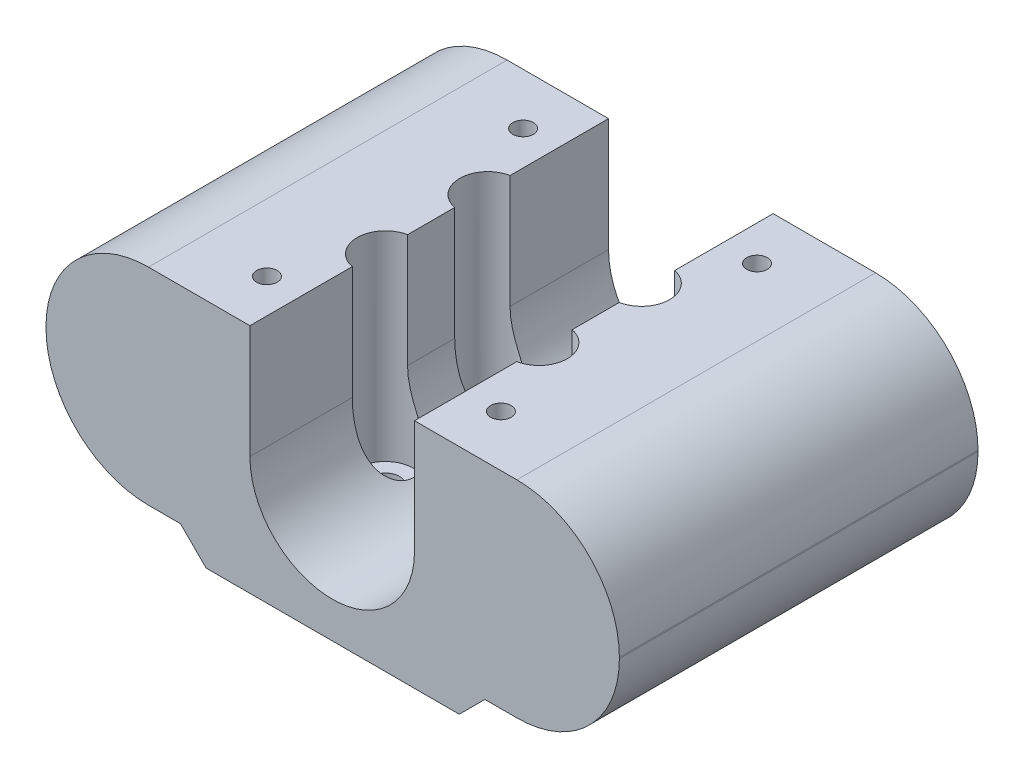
ISO-10303-21;
HEADER;
FILE_DESCRIPTION(('STEP AP214'),'2;1');
FILE_NAME('part.step','',(''),(''),'','','');
FILE_SCHEMA(('AUTOMOTIVE_DESIGN { 1 0 10303 214 1 1 1 1 }'));
ENDSEC;
DATA;
#1=APPLICATION_CONTEXT('core data for automotive mechanical design processes');
#2=APPLICATION_PROTOCOL_DEFINITION('international standard','automotive_design',2000,#1);
#3=PRODUCT_CONTEXT('',#1,'mechanical');
#4=PRODUCT('Part','Part','',(#3));
#5=PRODUCT_RELATED_PRODUCT_CATEGORY('part','',(#4));
#6=PRODUCT_DEFINITION_FORMATION('','',#4);
#7=PRODUCT_DEFINITION_CONTEXT('part definition',#1,'design');
#8=PRODUCT_DEFINITION('design','',#6,#7);
#9=PRODUCT_DEFINITION_SHAPE('','',#8);
#10=(LENGTH_UNIT() NAMED_UNIT(*) SI_UNIT(.MILLI.,.METRE.));
#11=(NAMED_UNIT(*) PLANE_ANGLE_UNIT() SI_UNIT($,.RADIAN.));
#12=(NAMED_UNIT(*) SI_UNIT($,.STERADIAN.) SOLID_ANGLE_UNIT());
#13=UNCERTAINTY_MEASURE_WITH_UNIT(LENGTH_MEASURE(1.E-05),#10,'distance_accuracy_value','');
#14=(GEOMETRIC_REPRESENTATION_CONTEXT(3) GLOBAL_UNCERTAINTY_ASSIGNED_CONTEXT((#13)) GLOBAL_UNIT_ASSIGNED_CONTEXT((#10,
#11,#12)) REPRESENTATION_CONTEXT('',''));
#15=CARTESIAN_POINT('',(0.,0.,0.));
#16=DIRECTION('',(0.,0.,1.));
#17=DIRECTION('',(1.,0.,0.));
#18=AXIS2_PLACEMENT_3D('',#15,#16,#17);
#19=CARTESIAN_POINT('',(-6.88258839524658,0.,-12.6421250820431));
#20=DIRECTION('',(1.,0.,0.));
#21=DIRECTION('',(0.,0.,-1.));
#22=AXIS2_PLACEMENT_3D('',#19,#20,#21);
#23=PLANE('',#22);
#24=DIRECTION('',(0.,1.,0.));
#25=VECTOR('',#24,1.);
#26=CARTESIAN_POINT('',(-6.88258839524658,18.1,3.04931637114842));
#27=LINE('',#26,#25);
#28=CARTESIAN_POINT('',(-6.88258839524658,9.25,3.04931637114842));
#29=VERTEX_POINT('',#28);
#30=CARTESIAN_POINT('',(-6.88258839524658,18.1,3.04931637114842));
#31=VERTEX_POINT('',#30);
#32=EDGE_CURVE('E362',#29,#31,#27,.T.);
#33=ORIENTED_EDGE('',*,*,#32,.F.);
#34=DIRECTION('',(0.,0.,1.));
#35=VECTOR('',#34,1.);
#36=CARTESIAN_POINT('',(-6.88258839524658,9.25,-12.6421250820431));
#37=LINE('',#36,#35);
#38=CARTESIAN_POINT('',(-6.88258839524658,9.25,-0.633566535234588));
#39=VERTEX_POINT('',#38);
#40=EDGE_CURVE('E454',#39,#29,#37,.T.);
#41=ORIENTED_EDGE('',*,*,#40,.F.);
#42=DIRECTION('',(0.,1.,0.));
#43=VECTOR('',#42,1.);
#44=CARTESIAN_POINT('',(-6.88258839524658,18.1,-0.633566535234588));
#45=LINE('',#44,#43);
#46=CARTESIAN_POINT('',(-6.88258839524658,18.1,-0.633566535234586));
#47=VERTEX_POINT('',#46);
#48=EDGE_CURVE('E418',#47,#39,#45,.F.);
#49=ORIENTED_EDGE('',*,*,#48,.F.);
#50=DIRECTION('',(0.,0.,1.));
#51=VECTOR('',#50,1.);
#52=CARTESIAN_POINT('',(-6.88258839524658,18.1,-12.6421250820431));
#53=LINE('',#52,#51);
#54=EDGE_CURVE('E440',#47,#31,#53,.T.);
#55=ORIENTED_EDGE('',*,*,#54,.T.);
#56=EDGE_LOOP('',(#33,#41,#49,#55));
#57=FACE_BOUND('',#56,.T.);
#58=ADVANCED_FACE('F34',(#57),#23,.T.);
#59=CARTESIAN_POINT('',(5.96741160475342,0.,-12.6421250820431));
#60=DIRECTION('',(1.,0.,0.));
#61=DIRECTION('',(0.,0.,-1.));
#62=AXIS2_PLACEMENT_3D('',#59,#60,#61);
#63=PLANE('',#62);
#64=DIRECTION('',(0.,0.,1.));
#65=VECTOR('',#64,1.);
#66=CARTESIAN_POINT('',(5.96741160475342,9.25,-12.6421250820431));
#67=LINE('',#66,#65);
#68=CARTESIAN_POINT('',(5.96741160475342,9.25,-0.633566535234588));
#69=VERTEX_POINT('',#68);
#70=CARTESIAN_POINT('',(5.96741160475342,9.25,3.04931637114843));
#71=VERTEX_POINT('',#70);
#72=EDGE_CURVE('E449',#69,#71,#67,.T.);
#73=ORIENTED_EDGE('',*,*,#72,.T.);
#74=DIRECTION('',(0.,1.,0.));
#75=VECTOR('',#74,1.);
#76=CARTESIAN_POINT('',(5.96741160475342,18.1,3.04931637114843));
#77=LINE('',#76,#75);
#78=CARTESIAN_POINT('',(5.96741160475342,18.1,3.04931637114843));
#79=VERTEX_POINT('',#78);
#80=EDGE_CURVE('E381',#71,#79,#77,.T.);
#81=ORIENTED_EDGE('',*,*,#80,.T.);
#82=DIRECTION('',(0.,0.,1.));
#83=VECTOR('',#82,1.);
#84=CARTESIAN_POINT('',(5.96741160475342,18.1,-12.6421250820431));
#85=LINE('',#84,#83);
#86=CARTESIAN_POINT('',(5.96741160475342,18.1,-0.633566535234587));
#87=VERTEX_POINT('',#86);
#88=EDGE_CURVE('E444',#87,#79,#85,.T.);
#89=ORIENTED_EDGE('',*,*,#88,.F.);
#90=DIRECTION('',(0.,1.,0.));
#91=VECTOR('',#90,1.);
#92=CARTESIAN_POINT('',(5.96741160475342,18.1,-0.633566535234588));
#93=LINE('',#92,#91);
#94=EDGE_CURVE('E398',#87,#69,#93,.F.);
#95=ORIENTED_EDGE('',*,*,#94,.T.);
#96=EDGE_LOOP('',(#73,#81,#89,#95));
#97=FACE_BOUND('',#96,.T.);
#98=ADVANCED_FACE('F502',(#97),#63,.F.);
#99=CARTESIAN_POINT('',(5.96741160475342,9.25,-12.6421250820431));
#100=VERTEX_POINT('',#99);
#101=CARTESIAN_POINT('',(5.96741160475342,9.25,-4.95068362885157));
#102=VERTEX_POINT('',#101);
#103=EDGE_CURVE('E446',#100,#102,#67,.T.);
#104=ORIENTED_EDGE('',*,*,#103,.T.);
#105=DIRECTION('',(0.,1.,0.));
#106=VECTOR('',#105,1.);
#107=CARTESIAN_POINT('',(5.96741160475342,18.1,-4.95068362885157));
#108=LINE('',#107,#106);
#109=CARTESIAN_POINT('',(5.96741160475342,18.1,-4.95068362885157));
#110=VERTEX_POINT('',#109);
#111=EDGE_CURVE('E401',#102,#110,#108,.T.);
#112=ORIENTED_EDGE('',*,*,#111,.T.);
#113=CARTESIAN_POINT('',(5.96741160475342,18.1,-12.6421250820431));
#114=VERTEX_POINT('',#113);
#115=EDGE_CURVE('E442',#114,#110,#85,.T.);
#116=ORIENTED_EDGE('',*,*,#115,.F.);
#117=DIRECTION('',(0.,1.,0.));
#118=VECTOR('',#117,1.);
#119=CARTESIAN_POINT('',(5.96741160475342,0.,-12.6421250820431));
#120=LINE('',#119,#118);
#121=EDGE_CURVE('E288',#100,#114,#120,.T.);
#122=ORIENTED_EDGE('',*,*,#121,.F.);
#123=EDGE_LOOP('',(#104,#112,#116,#122));
#124=FACE_BOUND('',#123,.T.);
#125=ADVANCED_FACE('F503',(#124),#63,.F.);
#126=DIRECTION('',(0.,1.,0.));
#127=VECTOR('',#126,1.);
#128=CARTESIAN_POINT('',(-6.88258839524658,18.1,-4.95068362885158));
#129=LINE('',#128,#127);
#130=CARTESIAN_POINT('',(-6.88258839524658,9.25,-4.95068362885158));
#131=VERTEX_POINT('',#130);
#132=CARTESIAN_POINT('',(-6.88258839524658,18.1,-4.95068362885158));
#133=VERTEX_POINT('',#132);
#134=EDGE_CURVE('E420',#131,#133,#129,.T.);
#135=ORIENTED_EDGE('',*,*,#134,.F.);
#136=CARTESIAN_POINT('',(-6.88258839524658,9.25,-12.6421250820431));
#137=VERTEX_POINT('',#136);
#138=EDGE_CURVE('E451',#137,#131,#37,.T.);
#139=ORIENTED_EDGE('',*,*,#138,.F.);
#140=DIRECTION('',(0.,1.,0.));
#141=VECTOR('',#140,1.);
#142=CARTESIAN_POINT('',(-6.88258839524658,0.,-12.6421250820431));
#143=LINE('',#142,#141);
#144=CARTESIAN_POINT('',(-6.88258839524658,18.1,-12.6421250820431));
#145=VERTEX_POINT('',#144);
#146=EDGE_CURVE('E423',#137,#145,#143,.T.);
#147=ORIENTED_EDGE('',*,*,#146,.T.);
#148=EDGE_CURVE('E437',#145,#133,#53,.T.);
#149=ORIENTED_EDGE('',*,*,#148,.T.);
#150=EDGE_LOOP('',(#135,#139,#147,#149));
#151=FACE_BOUND('',#150,.T.);
#152=ADVANCED_FACE('F511',(#151),#23,.T.);
#153=CARTESIAN_POINT('',(-10.4575883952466,18.1,15.3578749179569));
#154=DIRECTION('',(0.,0.,-1.));
#155=DIRECTION('',(-1.,0.,0.));
#156=AXIS2_PLACEMENT_3D('',#153,#154,#155);
#157=PLANE('',#156);
#158=DIRECTION('',(0.,1.,0.));
#159=VECTOR('',#158,1.);
#160=CARTESIAN_POINT('',(-22.8023273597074,2.00000000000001,15.3578749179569));
#161=LINE('',#160,#159);
#162=CARTESIAN_POINT('',(-22.8023273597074,10.,15.3578749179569));
#163=VERTEX_POINT('',#162);
#164=CARTESIAN_POINT('',(-22.8023273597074,10.1,15.3578749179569));
#165=VERTEX_POINT('',#164);
#166=EDGE_CURVE('E315',#163,#165,#161,.T.);
#167=ORIENTED_EDGE('',*,*,#166,.F.);
#168=CARTESIAN_POINT('',(-14.8023273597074,10.,15.3578749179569));
#169=DIRECTION('',(0.,0.,-1.));
#170=DIRECTION('',(-1.,0.,0.));
#171=AXIS2_PLACEMENT_3D('',#168,#169,#170);
#172=CIRCLE('',#171,8.);
#173=CARTESIAN_POINT('',(-14.8023273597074,2.00000000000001,15.3578749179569));
#174=VERTEX_POINT('',#173);
#175=EDGE_CURVE('E253',#163,#174,#172,.F.);
#176=ORIENTED_EDGE('',*,*,#175,.T.);
#177=DIRECTION('',(1.,0.,0.));
#178=VECTOR('',#177,1.);
#179=CARTESIAN_POINT('',(-22.8023273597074,2.00000000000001,15.3578749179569));
#180=LINE('',#179,#178);
#181=CARTESIAN_POINT('',(-12.3023273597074,2.00000000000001,15.3578749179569));
#182=VERTEX_POINT('',#181);
#183=EDGE_CURVE('E318',#174,#182,#180,.T.);
#184=ORIENTED_EDGE('',*,*,#183,.T.);
#185=DIRECTION('',(0.707106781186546,-0.707106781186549,0.));
#186=VECTOR('',#185,1.);
#187=CARTESIAN_POINT('',(-10.3023273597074,0.,15.3578749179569));
#188=LINE('',#187,#186);
#189=CARTESIAN_POINT('',(-10.3023273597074,0.,15.3578749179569));
#190=VERTEX_POINT('',#189);
#191=EDGE_CURVE('E227',#182,#190,#188,.T.);
#192=ORIENTED_EDGE('',*,*,#191,.T.);
#193=DIRECTION('',(1.,0.,0.));
#194=VECTOR('',#193,1.);
#195=CARTESIAN_POINT('',(-10.4575883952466,0.,15.3578749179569));
#196=LINE('',#195,#194);
#197=CARTESIAN_POINT('',(9.46218817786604,0.,15.3578749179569));
#198=VERTEX_POINT('',#197);
#199=EDGE_CURVE('E223',#190,#198,#196,.T.);
#200=ORIENTED_EDGE('',*,*,#199,.T.);
#201=DIRECTION('',(0.707106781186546,0.707106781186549,0.));
#202=VECTOR('',#201,1.);
#203=CARTESIAN_POINT('',(9.46218817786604,0.,15.3578749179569));
#204=LINE('',#203,#202);
#205=CARTESIAN_POINT('',(11.462188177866,2.00000000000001,15.3578749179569));
#206=VERTEX_POINT('',#205);
#207=EDGE_CURVE('E219',#198,#206,#204,.T.);
#208=ORIENTED_EDGE('',*,*,#207,.T.);
#209=DIRECTION('',(-1.,0.,0.));
#210=VECTOR('',#209,1.);
#211=CARTESIAN_POINT('',(21.962188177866,2.00000000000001,15.3578749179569));
#212=LINE('',#211,#210);
#213=CARTESIAN_POINT('',(13.962188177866,2.00000000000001,15.3578749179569));
#214=VERTEX_POINT('',#213);
#215=EDGE_CURVE('E206',#214,#206,#212,.T.);
#216=ORIENTED_EDGE('',*,*,#215,.F.);
#217=CARTESIAN_POINT('',(13.962188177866,10.,15.3578749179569));
#218=DIRECTION('',(0.,0.,-1.));
#219=DIRECTION('',(-1.,0.,0.));
#220=AXIS2_PLACEMENT_3D('',#217,#218,#219);
#221=CIRCLE('',#220,8.);
#222=CARTESIAN_POINT('',(21.962188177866,10.,15.3578749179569));
#223=VERTEX_POINT('',#222);
#224=EDGE_CURVE('E247',#214,#223,#221,.F.);
#225=ORIENTED_EDGE('',*,*,#224,.T.);
#226=DIRECTION('',(0.,-1.,0.));
#227=VECTOR('',#226,1.);
#228=CARTESIAN_POINT('',(21.962188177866,18.1,15.3578749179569));
#229=LINE('',#228,#227);
#230=CARTESIAN_POINT('',(21.962188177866,10.1,15.3578749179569));
#231=VERTEX_POINT('',#230);
#232=EDGE_CURVE('E298',#231,#223,#229,.T.);
#233=ORIENTED_EDGE('',*,*,#232,.F.);
#234=CARTESIAN_POINT('',(13.962188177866,10.1,15.3578749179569));
#235=DIRECTION('',(0.,0.,-1.));
#236=DIRECTION('',(-1.,0.,0.));
#237=AXIS2_PLACEMENT_3D('',#234,#235,#236);
#238=CIRCLE('',#237,8.);
#239=CARTESIAN_POINT('',(13.962188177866,18.1,15.3578749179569));
#240=VERTEX_POINT('',#239);
#241=EDGE_CURVE('E249',#231,#240,#238,.F.);
#242=ORIENTED_EDGE('',*,*,#241,.T.);
#243=DIRECTION('',(1.,0.,0.));
#244=VECTOR('',#243,1.);
#245=CARTESIAN_POINT('',(-10.4575883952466,18.1,15.3578749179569));
#246=LINE('',#245,#244);
#247=CARTESIAN_POINT('',(5.96741160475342,18.1,15.3578749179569));
#248=VERTEX_POINT('',#247);
#249=EDGE_CURVE('E279',#248,#240,#246,.T.);
#250=ORIENTED_EDGE('',*,*,#249,.F.);
#251=DIRECTION('',(0.,1.,0.));
#252=VECTOR('',#251,1.);
#253=CARTESIAN_POINT('',(5.96741160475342,0.,15.3578749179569));
#254=LINE('',#253,#252);
#255=CARTESIAN_POINT('',(5.96741160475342,9.25,15.3578749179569));
#256=VERTEX_POINT('',#255);
#257=EDGE_CURVE('E426',#256,#248,#254,.T.);
#258=ORIENTED_EDGE('',*,*,#257,.F.);
#259=CARTESIAN_POINT('',(-0.45758839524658,9.25,15.3578749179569));
#260=DIRECTION('',(0.,0.,1.));
#261=DIRECTION('',(1.,0.,0.));
#262=AXIS2_PLACEMENT_3D('',#259,#260,#261);
#263=CIRCLE('',#262,6.425);
#264=CARTESIAN_POINT('',(-6.88258839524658,9.25,15.3578749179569));
#265=VERTEX_POINT('',#264);
#266=EDGE_CURVE('E432',#265,#256,#263,.T.);
#267=ORIENTED_EDGE('',*,*,#266,.F.);
#268=DIRECTION('',(0.,1.,0.));
#269=VECTOR('',#268,1.);
#270=CARTESIAN_POINT('',(-6.88258839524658,0.,15.3578749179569));
#271=LINE('',#270,#269);
#272=CARTESIAN_POINT('',(-6.88258839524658,18.1,15.3578749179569));
#273=VERTEX_POINT('',#272);
#274=EDGE_CURVE('E422',#265,#273,#271,.T.);
#275=ORIENTED_EDGE('',*,*,#274,.T.);
#276=CARTESIAN_POINT('',(-14.8023273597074,18.1,15.3578749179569));
#277=VERTEX_POINT('',#276);
#278=EDGE_CURVE('E455',#277,#273,#246,.T.);
#279=ORIENTED_EDGE('',*,*,#278,.F.);
#280=CARTESIAN_POINT('',(-14.8023273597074,10.1,15.3578749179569));
#281=DIRECTION('',(0.,0.,-1.));
#282=DIRECTION('',(-1.,0.,0.));
#283=AXIS2_PLACEMENT_3D('',#280,#281,#282);
#284=CIRCLE('',#283,8.);
#285=EDGE_CURVE('E251',#277,#165,#284,.F.);
#286=ORIENTED_EDGE('',*,*,#285,.T.);
#287=EDGE_LOOP('',(#167,#176,#184,#192,#200,#208,#216,#225,#233,#242,#250,#258,#267,#275,#279,#286));
#288=FACE_BOUND('',#287,.T.);
#289=ADVANCED_FACE('F221',(#288),#157,.F.);
#290=CARTESIAN_POINT('',(-10.4575883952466,18.1,-12.6421250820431));
#291=DIRECTION('',(0.,0.,1.));
#292=DIRECTION('',(1.,0.,0.));
#293=AXIS2_PLACEMENT_3D('',#290,#291,#292);
#294=PLANE('',#293);
#295=CARTESIAN_POINT('',(15.9674116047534,9.25,-12.6421250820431));
#296=DIRECTION('',(0.,0.,-1.));
#297=DIRECTION('',(-1.,0.,0.));
#298=AXIS2_PLACEMENT_3D('',#295,#296,#297);
#299=CIRCLE('',#298,4.25);
#300=CARTESIAN_POINT('',(11.7174116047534,9.25,-12.6421250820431));
#301=VERTEX_POINT('',#300);
#302=EDGE_CURVE('E728',#301,#301,#299,.T.);
#303=ORIENTED_EDGE('',*,*,#302,.F.);
#304=EDGE_LOOP('',(#303));
#305=FACE_BOUND('',#304,.T.);
#306=CARTESIAN_POINT('',(-16.8825883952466,9.25,-12.6421250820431));
#307=DIRECTION('',(0.,0.,-1.));
#308=DIRECTION('',(-1.,0.,0.));
#309=AXIS2_PLACEMENT_3D('',#306,#307,#308);
#310=CIRCLE('',#309,4.25);
#311=CARTESIAN_POINT('',(-21.1325883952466,9.25,-12.6421250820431));
#312=VERTEX_POINT('',#311);
#313=EDGE_CURVE('E215',#312,#312,#310,.T.);
#314=ORIENTED_EDGE('',*,*,#313,.F.);
#315=EDGE_LOOP('',(#314));
#316=FACE_BOUND('',#315,.T.);
#317=DIRECTION('',(1.,0.,0.));
#318=VECTOR('',#317,1.);
#319=CARTESIAN_POINT('',(-22.8023273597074,2.00000000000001,-12.6421250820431));
#320=LINE('',#319,#318);
#321=CARTESIAN_POINT('',(-14.8023273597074,2.00000000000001,-12.6421250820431));
#322=VERTEX_POINT('',#321);
#323=CARTESIAN_POINT('',(-12.3023273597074,2.00000000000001,-12.6421250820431));
#324=VERTEX_POINT('',#323);
#325=EDGE_CURVE('E320',#322,#324,#320,.T.);
#326=ORIENTED_EDGE('',*,*,#325,.F.);
#327=CARTESIAN_POINT('',(-14.8023273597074,10.,-12.6421250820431));
#328=DIRECTION('',(0.,0.,1.));
#329=DIRECTION('',(1.,0.,0.));
#330=AXIS2_PLACEMENT_3D('',#327,#328,#329);
#331=CIRCLE('',#330,8.);
#332=CARTESIAN_POINT('',(-22.8023273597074,10.,-12.6421250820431));
#333=VERTEX_POINT('',#332);
#334=EDGE_CURVE('E261',#322,#333,#331,.F.);
#335=ORIENTED_EDGE('',*,*,#334,.T.);
#336=DIRECTION('',(0.,-1.,0.));
#337=VECTOR('',#336,1.);
#338=CARTESIAN_POINT('',(-22.8023273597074,2.00000000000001,-12.6421250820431));
#339=LINE('',#338,#337);
#340=CARTESIAN_POINT('',(-22.8023273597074,10.1,-12.6421250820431));
#341=VERTEX_POINT('',#340);
#342=EDGE_CURVE('E310',#341,#333,#339,.T.);
#343=ORIENTED_EDGE('',*,*,#342,.F.);
#344=CARTESIAN_POINT('',(-14.8023273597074,10.1,-12.6421250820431));
#345=DIRECTION('',(0.,0.,1.));
#346=DIRECTION('',(1.,0.,0.));
#347=AXIS2_PLACEMENT_3D('',#344,#345,#346);
#348=CIRCLE('',#347,8.);
#349=CARTESIAN_POINT('',(-14.8023273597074,18.1,-12.6421250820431));
#350=VERTEX_POINT('',#349);
#351=EDGE_CURVE('E49',#341,#350,#348,.F.);
#352=ORIENTED_EDGE('',*,*,#351,.T.);
#353=DIRECTION('',(-1.,0.,0.));
#354=VECTOR('',#353,1.);
#355=CARTESIAN_POINT('',(-10.4575883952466,18.1,-12.6421250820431));
#356=LINE('',#355,#354);
#357=EDGE_CURVE('E290',#145,#350,#356,.T.);
#358=ORIENTED_EDGE('',*,*,#357,.F.);
#359=ORIENTED_EDGE('',*,*,#146,.F.);
#360=CARTESIAN_POINT('',(-0.45758839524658,9.25,-12.6421250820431));
#361=DIRECTION('',(0.,0.,1.));
#362=DIRECTION('',(1.,0.,0.));
#363=AXIS2_PLACEMENT_3D('',#360,#361,#362);
#364=CIRCLE('',#363,6.425);
#365=EDGE_CURVE('E425',#137,#100,#364,.T.);
#366=ORIENTED_EDGE('',*,*,#365,.T.);
#367=ORIENTED_EDGE('',*,*,#121,.T.);
#368=CARTESIAN_POINT('',(13.962188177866,18.1,-12.6421250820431));
#369=VERTEX_POINT('',#368);
#370=EDGE_CURVE('E276',#369,#114,#356,.T.);
#371=ORIENTED_EDGE('',*,*,#370,.F.);
#372=CARTESIAN_POINT('',(13.962188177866,10.1,-12.6421250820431));
#373=DIRECTION('',(0.,0.,1.));
#374=DIRECTION('',(1.,0.,0.));
#375=AXIS2_PLACEMENT_3D('',#372,#373,#374);
#376=CIRCLE('',#375,8.);
#377=CARTESIAN_POINT('',(21.962188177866,10.1,-12.6421250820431));
#378=VERTEX_POINT('',#377);
#379=EDGE_CURVE('E258',#369,#378,#376,.F.);
#380=ORIENTED_EDGE('',*,*,#379,.T.);
#381=DIRECTION('',(0.,1.,0.));
#382=VECTOR('',#381,1.);
#383=CARTESIAN_POINT('',(21.962188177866,18.1,-12.6421250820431));
#384=LINE('',#383,#382);
#385=CARTESIAN_POINT('',(21.962188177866,10.,-12.6421250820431));
#386=VERTEX_POINT('',#385);
#387=EDGE_CURVE('E300',#386,#378,#384,.T.);
#388=ORIENTED_EDGE('',*,*,#387,.F.);
#389=CARTESIAN_POINT('',(13.962188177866,10.,-12.6421250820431));
#390=DIRECTION('',(0.,0.,1.));
#391=DIRECTION('',(1.,0.,0.));
#392=AXIS2_PLACEMENT_3D('',#389,#390,#391);
#393=CIRCLE('',#392,8.);
#394=CARTESIAN_POINT('',(13.962188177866,2.00000000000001,-12.6421250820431));
#395=VERTEX_POINT('',#394);
#396=EDGE_CURVE('E56',#386,#395,#393,.F.);
#397=ORIENTED_EDGE('',*,*,#396,.T.);
#398=DIRECTION('',(-1.,0.,0.));
#399=VECTOR('',#398,1.);
#400=CARTESIAN_POINT('',(21.962188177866,2.00000000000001,-12.6421250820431));
#401=LINE('',#400,#399);
#402=CARTESIAN_POINT('',(11.462188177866,2.00000000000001,-12.6421250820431));
#403=VERTEX_POINT('',#402);
#404=EDGE_CURVE('E216',#395,#403,#401,.T.);
#405=ORIENTED_EDGE('',*,*,#404,.T.);
#406=DIRECTION('',(-0.707106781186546,-0.707106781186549,0.));
#407=VECTOR('',#406,1.);
#408=CARTESIAN_POINT('',(9.46218817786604,0.,-12.6421250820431));
#409=LINE('',#408,#407);
#410=CARTESIAN_POINT('',(9.46218817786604,0.,-12.6421250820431));
#411=VERTEX_POINT('',#410);
#412=EDGE_CURVE('E230',#403,#411,#409,.T.);
#413=ORIENTED_EDGE('',*,*,#412,.T.);
#414=DIRECTION('',(-1.,0.,0.));
#415=VECTOR('',#414,1.);
#416=CARTESIAN_POINT('',(-10.4575883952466,0.,-12.6421250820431));
#417=LINE('',#416,#415);
#418=CARTESIAN_POINT('',(-10.3023273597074,0.,-12.6421250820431));
#419=VERTEX_POINT('',#418);
#420=EDGE_CURVE('E458',#411,#419,#417,.T.);
#421=ORIENTED_EDGE('',*,*,#420,.T.);
#422=DIRECTION('',(-0.707106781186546,0.707106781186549,0.));
#423=VECTOR('',#422,1.);
#424=CARTESIAN_POINT('',(-10.3023273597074,0.,-12.6421250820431));
#425=LINE('',#424,#423);
#426=EDGE_CURVE('E231',#419,#324,#425,.T.);
#427=ORIENTED_EDGE('',*,*,#426,.T.);
#428=EDGE_LOOP('',(#326,#335,#343,#352,#358,#359,#366,#367,#371,#380,#388,#397,#405,#413,#421,#427));
#429=FACE_BOUND('',#428,.T.);
#430=ADVANCED_FACE('F284',(#305,#316,#429),#294,.F.);
#431=CARTESIAN_POINT('',(0.,18.1,0.));
#432=DIRECTION('',(0.,1.,0.));
#433=DIRECTION('',(0.,0.,1.));
#434=AXIS2_PLACEMENT_3D('',#431,#432,#433);
#435=PLANE('',#434);
#436=CARTESIAN_POINT('',(-9.55232735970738,18.1,11.3578749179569));
#437=DIRECTION('',(0.,1.,0.));
#438=DIRECTION('',(0.,0.,1.));
#439=AXIS2_PLACEMENT_3D('',#436,#437,#438);
#440=CIRCLE('',#439,0.799999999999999);
#441=CARTESIAN_POINT('',(-9.55232735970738,18.1,12.1578749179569));
#442=VERTEX_POINT('',#441);
#443=EDGE_CURVE('E334',#442,#442,#440,.T.);
#444=ORIENTED_EDGE('',*,*,#443,.F.);
#445=EDGE_LOOP('',(#444));
#446=FACE_BOUND('',#445,.T.);
#447=CARTESIAN_POINT('',(-9.55232735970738,18.1,-8.64212508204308));
#448=DIRECTION('',(0.,1.,0.));
#449=DIRECTION('',(0.,0.,1.));
#450=AXIS2_PLACEMENT_3D('',#447,#448,#449);
#451=CIRCLE('',#450,0.799999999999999);
#452=CARTESIAN_POINT('',(-9.55232735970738,18.1,-7.84212508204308));
#453=VERTEX_POINT('',#452);
#454=EDGE_CURVE('E340',#453,#453,#451,.T.);
#455=ORIENTED_EDGE('',*,*,#454,.F.);
#456=EDGE_LOOP('',(#455));
#457=FACE_BOUND('',#456,.T.);
#458=ORIENTED_EDGE('',*,*,#357,.T.);
#459=DIRECTION('',(0.,0.,-1.));
#460=VECTOR('',#459,1.);
#461=CARTESIAN_POINT('',(-14.8023273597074,18.1,15.3578749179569));
#462=LINE('',#461,#460);
#463=EDGE_CURVE('E263',#350,#277,#462,.F.);
#464=ORIENTED_EDGE('',*,*,#463,.T.);
#465=ORIENTED_EDGE('',*,*,#278,.T.);
#466=CARTESIAN_POINT('',(-6.88258839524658,18.1,7.36643346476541));
#467=VERTEX_POINT('',#466);
#468=EDGE_CURVE('E441',#467,#273,#53,.T.);
#469=ORIENTED_EDGE('',*,*,#468,.F.);
#470=CARTESIAN_POINT('',(-6.45758839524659,18.1,5.20787491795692));
#471=DIRECTION('',(0.,1.,0.));
#472=DIRECTION('',(0.,0.,1.));
#473=AXIS2_PLACEMENT_3D('',#470,#471,#472);
#474=CIRCLE('',#473,2.2);
#475=EDGE_CURVE('E349',#31,#467,#474,.T.);
#476=ORIENTED_EDGE('',*,*,#475,.F.);
#477=ORIENTED_EDGE('',*,*,#54,.F.);
#478=CARTESIAN_POINT('',(-6.45758839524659,18.1,-2.79212508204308));
#479=DIRECTION('',(0.,1.,0.));
#480=DIRECTION('',(0.,0.,1.));
#481=AXIS2_PLACEMENT_3D('',#478,#479,#480);
#482=CIRCLE('',#481,2.2);
#483=EDGE_CURVE('E407',#133,#47,#482,.T.);
#484=ORIENTED_EDGE('',*,*,#483,.F.);
#485=ORIENTED_EDGE('',*,*,#148,.F.);
#486=EDGE_LOOP('',(#458,#464,#465,#469,#476,#477,#484,#485));
#487=FACE_BOUND('',#486,.T.);
#488=ADVANCED_FACE('F538',(#446,#457,#487),#435,.T.);
#489=CARTESIAN_POINT('',(8.71218817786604,18.1,-8.64212508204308));
#490=DIRECTION('',(0.,1.,0.));
#491=DIRECTION('',(0.,0.,1.));
#492=AXIS2_PLACEMENT_3D('',#489,#490,#491);
#493=CIRCLE('',#492,0.799999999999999);
#494=CARTESIAN_POINT('',(8.71218817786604,18.1,-7.84212508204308));
#495=VERTEX_POINT('',#494);
#496=EDGE_CURVE('E322',#495,#495,#493,.T.);
#497=ORIENTED_EDGE('',*,*,#496,.F.);
#498=EDGE_LOOP('',(#497));
#499=FACE_BOUND('',#498,.T.);
#500=CARTESIAN_POINT('',(8.71218817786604,18.1,11.3578749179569));
#501=DIRECTION('',(0.,1.,0.));
#502=DIRECTION('',(0.,0.,1.));
#503=AXIS2_PLACEMENT_3D('',#500,#501,#502);
#504=CIRCLE('',#503,0.799999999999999);
#505=CARTESIAN_POINT('',(8.71218817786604,18.1,12.1578749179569));
#506=VERTEX_POINT('',#505);
#507=EDGE_CURVE('E328',#506,#506,#504,.T.);
#508=ORIENTED_EDGE('',*,*,#507,.F.);
#509=EDGE_LOOP('',(#508));
#510=FACE_BOUND('',#509,.T.);
#511=ORIENTED_EDGE('',*,*,#249,.T.);
#512=DIRECTION('',(0.,0.,1.));
#513=VECTOR('',#512,1.);
#514=CARTESIAN_POINT('',(13.962188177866,18.1,-12.6421250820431));
#515=LINE('',#514,#513);
#516=EDGE_CURVE('E42',#240,#369,#515,.F.);
#517=ORIENTED_EDGE('',*,*,#516,.T.);
#518=ORIENTED_EDGE('',*,*,#370,.T.);
#519=ORIENTED_EDGE('',*,*,#115,.T.);
#520=CARTESIAN_POINT('',(5.54241160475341,18.1,-2.79212508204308));
#521=DIRECTION('',(0.,1.,0.));
#522=DIRECTION('',(0.,0.,1.));
#523=AXIS2_PLACEMENT_3D('',#520,#521,#522);
#524=CIRCLE('',#523,2.2);
#525=EDGE_CURVE('E387',#87,#110,#524,.T.);
#526=ORIENTED_EDGE('',*,*,#525,.F.);
#527=ORIENTED_EDGE('',*,*,#88,.T.);
#528=CARTESIAN_POINT('',(5.54241160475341,18.1,5.20787491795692));
#529=DIRECTION('',(0.,1.,0.));
#530=DIRECTION('',(0.,0.,1.));
#531=AXIS2_PLACEMENT_3D('',#528,#529,#530);
#532=CIRCLE('',#531,2.2);
#533=CARTESIAN_POINT('',(5.96741160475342,18.1,7.36643346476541));
#534=VERTEX_POINT('',#533);
#535=EDGE_CURVE('E367',#534,#79,#532,.T.);
#536=ORIENTED_EDGE('',*,*,#535,.F.);
#537=EDGE_CURVE('E445',#534,#248,#85,.T.);
#538=ORIENTED_EDGE('',*,*,#537,.T.);
#539=EDGE_LOOP('',(#511,#517,#518,#519,#526,#527,#536,#538));
#540=FACE_BOUND('',#539,.T.);
#541=ADVANCED_FACE('F274',(#499,#510,#540),#435,.T.);
#542=CARTESIAN_POINT('',(0.,0.,0.));
#543=DIRECTION('',(0.,1.,0.));
#544=DIRECTION('',(0.,0.,1.));
#545=AXIS2_PLACEMENT_3D('',#542,#543,#544);
#546=PLANE('',#545);
#547=CARTESIAN_POINT('',(-6.45758839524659,0.,5.20787491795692));
#548=DIRECTION('',(0.,1.,0.));
#549=DIRECTION('',(0.,0.,1.));
#550=AXIS2_PLACEMENT_3D('',#547,#548,#549);
#551=CIRCLE('',#550,1.225);
#552=CARTESIAN_POINT('',(-6.45758839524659,0.,6.43287491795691));
#553=VERTEX_POINT('',#552);
#554=EDGE_CURVE('E346',#553,#553,#551,.T.);
#555=ORIENTED_EDGE('',*,*,#554,.T.);
#556=EDGE_LOOP('',(#555));
#557=FACE_BOUND('',#556,.T.);
#558=CARTESIAN_POINT('',(5.54241160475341,0.,5.20787491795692));
#559=DIRECTION('',(0.,1.,0.));
#560=DIRECTION('',(0.,0.,1.));
#561=AXIS2_PLACEMENT_3D('',#558,#559,#560);
#562=CIRCLE('',#561,1.225);
#563=CARTESIAN_POINT('',(5.54241160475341,0.,6.43287491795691));
#564=VERTEX_POINT('',#563);
#565=EDGE_CURVE('E364',#564,#564,#562,.T.);
#566=ORIENTED_EDGE('',*,*,#565,.T.);
#567=EDGE_LOOP('',(#566));
#568=FACE_BOUND('',#567,.T.);
#569=CARTESIAN_POINT('',(5.54241160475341,0.,-2.79212508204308));
#570=DIRECTION('',(0.,1.,0.));
#571=DIRECTION('',(0.,0.,1.));
#572=AXIS2_PLACEMENT_3D('',#569,#570,#571);
#573=CIRCLE('',#572,1.225);
#574=CARTESIAN_POINT('',(5.54241160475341,0.,-1.56712508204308));
#575=VERTEX_POINT('',#574);
#576=EDGE_CURVE('E384',#575,#575,#573,.T.);
#577=ORIENTED_EDGE('',*,*,#576,.T.);
#578=EDGE_LOOP('',(#577));
#579=FACE_BOUND('',#578,.T.);
#580=CARTESIAN_POINT('',(-6.45758839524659,0.,-2.79212508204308));
#581=DIRECTION('',(0.,1.,0.));
#582=DIRECTION('',(0.,0.,1.));
#583=AXIS2_PLACEMENT_3D('',#580,#581,#582);
#584=CIRCLE('',#583,1.225);
#585=CARTESIAN_POINT('',(-6.45758839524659,0.,-1.56712508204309));
#586=VERTEX_POINT('',#585);
#587=EDGE_CURVE('E404',#586,#586,#584,.T.);
#588=ORIENTED_EDGE('',*,*,#587,.T.);
#589=EDGE_LOOP('',(#588));
#590=FACE_BOUND('',#589,.T.);
#591=ORIENTED_EDGE('',*,*,#420,.F.);
#592=DIRECTION('',(0.,0.,1.));
#593=VECTOR('',#592,1.);
#594=CARTESIAN_POINT('',(9.46218817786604,0.,15.3578749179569));
#595=LINE('',#594,#593);
#596=EDGE_CURVE('E628',#411,#198,#595,.T.);
#597=ORIENTED_EDGE('',*,*,#596,.T.);
#598=ORIENTED_EDGE('',*,*,#199,.F.);
#599=DIRECTION('',(0.,0.,-1.));
#600=VECTOR('',#599,1.);
#601=CARTESIAN_POINT('',(-10.3023273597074,0.,-12.6421250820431));
#602=LINE('',#601,#600);
#603=EDGE_CURVE('E563',#190,#419,#602,.T.);
#604=ORIENTED_EDGE('',*,*,#603,.T.);
#605=EDGE_LOOP('',(#591,#597,#598,#604));
#606=FACE_BOUND('',#605,.T.);
#607=ADVANCED_FACE('F509',(#557,#568,#579,#590,#606),#546,.F.);
#608=DIRECTION('',(0.,1.,0.));
#609=VECTOR('',#608,1.);
#610=CARTESIAN_POINT('',(-6.88258839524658,18.1,7.36643346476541));
#611=LINE('',#610,#609);
#612=CARTESIAN_POINT('',(-6.88258839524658,9.25,7.36643346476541));
#613=VERTEX_POINT('',#612);
#614=EDGE_CURVE('E360',#467,#613,#611,.F.);
#615=ORIENTED_EDGE('',*,*,#614,.F.);
#616=ORIENTED_EDGE('',*,*,#468,.T.);
#617=ORIENTED_EDGE('',*,*,#274,.F.);
#618=EDGE_CURVE('E429',#613,#265,#37,.T.);
#619=ORIENTED_EDGE('',*,*,#618,.F.);
#620=EDGE_LOOP('',(#615,#616,#617,#619));
#621=FACE_BOUND('',#620,.T.);
#622=ADVANCED_FACE('F500',(#621),#23,.T.);
#623=ORIENTED_EDGE('',*,*,#537,.F.);
#624=DIRECTION('',(0.,1.,0.));
#625=VECTOR('',#624,1.);
#626=CARTESIAN_POINT('',(5.96741160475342,18.1,7.36643346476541));
#627=LINE('',#626,#625);
#628=CARTESIAN_POINT('',(5.96741160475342,9.25,7.36643346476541));
#629=VERTEX_POINT('',#628);
#630=EDGE_CURVE('E378',#534,#629,#627,.F.);
#631=ORIENTED_EDGE('',*,*,#630,.T.);
#632=EDGE_CURVE('E450',#629,#256,#67,.T.);
#633=ORIENTED_EDGE('',*,*,#632,.T.);
#634=ORIENTED_EDGE('',*,*,#257,.T.);
#635=EDGE_LOOP('',(#623,#631,#633,#634));
#636=FACE_BOUND('',#635,.T.);
#637=ADVANCED_FACE('F498',(#636),#63,.F.);
#638=CARTESIAN_POINT('',(-0.45758839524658,9.25,-12.6421250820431));
#639=DIRECTION('',(0.,0.,1.));
#640=DIRECTION('',(1.,0.,0.));
#641=AXIS2_PLACEMENT_3D('',#638,#639,#640);
#642=CYLINDRICAL_SURFACE('',#641,6.425);
#643=ORIENTED_EDGE('',*,*,#40,.T.);
#644=CARTESIAN_POINT('',(-6.88258839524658,9.25,3.04931637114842));
#645=CARTESIAN_POINT('',(-6.88258956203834,9.16104198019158,3.04932691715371));
#646=CARTESIAN_POINT('',(-6.88074089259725,9.07208533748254,3.04895287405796));
#647=CARTESIAN_POINT('',(-6.87335295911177,8.89433365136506,3.04751251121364));
#648=CARTESIAN_POINT('',(-6.86781380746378,8.80553860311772,3.04644621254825));
#649=CARTESIAN_POINT('',(-6.8530530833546,8.62825266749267,3.04369806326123));
#650=CARTESIAN_POINT('',(-6.84383106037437,8.53976181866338,3.04201613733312));
#651=CARTESIAN_POINT('',(-6.82172388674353,8.36325450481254,3.03819075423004));
#652=CARTESIAN_POINT('',(-6.80883872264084,8.27523804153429,3.03604729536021));
#653=CARTESIAN_POINT('',(-6.76450514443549,8.01084452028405,3.02917806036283));
#654=CARTESIAN_POINT('',(-6.72748314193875,7.83538077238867,3.02403796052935));
#655=CARTESIAN_POINT('',(-6.63890901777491,7.48818477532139,3.01490885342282));
#656=CARTESIAN_POINT('',(-6.58736081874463,7.31645153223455,3.01091953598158));
#657=CARTESIAN_POINT('',(-6.48448107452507,7.01942477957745,3.00759601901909));
#658=CARTESIAN_POINT('',(-6.43620232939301,6.89307946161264,3.00735951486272));
#659=CARTESIAN_POINT('',(-6.33178175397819,6.64370995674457,3.01085302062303));
#660=CARTESIAN_POINT('',(-6.27563961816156,6.52068589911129,3.01458318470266));
#661=CARTESIAN_POINT('',(-6.1560470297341,6.27909471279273,3.02781126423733));
#662=CARTESIAN_POINT('',(-6.09262454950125,6.16051270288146,3.03728766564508));
#663=CARTESIAN_POINT('',(-5.95892400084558,5.92826869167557,3.06405070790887));
#664=CARTESIAN_POINT('',(-5.88864954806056,5.81460414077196,3.08133324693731));
#665=CARTESIAN_POINT('',(-5.72336767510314,5.56491877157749,3.1317795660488));
#666=CARTESIAN_POINT('',(-5.62661840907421,5.43057358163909,3.16786636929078));
#667=CARTESIAN_POINT('',(-5.47699394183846,5.23841280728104,3.23773501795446));
#668=CARTESIAN_POINT('',(-5.42637488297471,5.17592512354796,3.2636438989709));
#669=CARTESIAN_POINT('',(-5.32426700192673,5.05448441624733,3.32133726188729));
#670=CARTESIAN_POINT('',(-5.27277838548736,4.99553057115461,3.35312037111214));
#671=CARTESIAN_POINT('',(-5.14006608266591,4.84890986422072,3.44329127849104));
#672=CARTESIAN_POINT('',(-5.05873922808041,4.76418626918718,3.50647822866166));
#673=CARTESIAN_POINT('',(-4.90000486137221,4.60693699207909,3.65051329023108));
#674=CARTESIAN_POINT('',(-4.82259303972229,4.53439768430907,3.73134143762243));
#675=CARTESIAN_POINT('',(-4.68857045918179,4.41407122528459,3.89639149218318));
#676=CARTESIAN_POINT('',(-4.63061641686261,4.36417957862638,3.97797832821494));
#677=CARTESIAN_POINT('',(-4.52442579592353,4.27543919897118,4.15273584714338));
#678=CARTESIAN_POINT('',(-4.47618666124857,4.23658756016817,4.24590347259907));
#679=CARTESIAN_POINT('',(-4.39236110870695,4.1705243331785,4.44219079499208));
#680=CARTESIAN_POINT('',(-4.35683256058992,4.14336587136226,4.54535335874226));
#681=CARTESIAN_POINT('',(-4.30123628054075,4.1013855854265,4.75817711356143));
#682=CARTESIAN_POINT('',(-4.2811652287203,4.086561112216,4.86783690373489));
#683=CARTESIAN_POINT('',(-4.2588925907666,4.0701467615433,5.08055983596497));
#684=CARTESIAN_POINT('',(-4.25533531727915,4.06755254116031,5.18340636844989));
#685=CARTESIAN_POINT('',(-4.26260607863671,4.07288808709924,5.38829502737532));
#686=CARTESIAN_POINT('',(-4.27343009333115,4.08081491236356,5.49033737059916));
#687=CARTESIAN_POINT('',(-4.30834269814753,4.1067747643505,5.68805009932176));
#688=CARTESIAN_POINT('',(-4.33208660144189,4.12454538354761,5.78381656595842));
#689=CARTESIAN_POINT('',(-4.391235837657,4.16980120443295,5.9692279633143));
#690=CARTESIAN_POINT('',(-4.42664111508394,4.19728635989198,6.05887292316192));
#691=CARTESIAN_POINT('',(-4.50849234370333,4.26265403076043,6.23284727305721));
#692=CARTESIAN_POINT('',(-4.55526191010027,4.30084758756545,6.31690641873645));
#693=CARTESIAN_POINT('',(-4.65662874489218,4.3865564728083,6.47490566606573));
#694=CARTESIAN_POINT('',(-4.71122849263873,4.43407475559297,6.54884254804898));
#695=CARTESIAN_POINT('',(-4.8313356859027,4.54275648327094,6.69278136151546));
#696=CARTESIAN_POINT('',(-4.89738790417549,4.60480906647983,6.76165131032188));
#697=CARTESIAN_POINT('',(-5.03254909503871,4.7378660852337,6.88648826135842));
#698=CARTESIAN_POINT('',(-5.10165956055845,4.80887492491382,6.94244887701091));
#699=CARTESIAN_POINT('',(-5.22526824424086,4.94230145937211,7.0315736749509));
#700=CARTESIAN_POINT('',(-5.27970183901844,5.00326699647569,7.06705130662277));
#701=CARTESIAN_POINT('',(-5.38782909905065,5.12929082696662,7.13130188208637));
#702=CARTESIAN_POINT('',(-5.44152241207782,5.19435099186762,7.16007173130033));
#703=CARTESIAN_POINT('',(-5.54745079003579,5.32811017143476,7.21165330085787));
#704=CARTESIAN_POINT('',(-5.59968304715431,5.39681554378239,7.23445417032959));
#705=CARTESIAN_POINT('',(-5.70201897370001,5.53730092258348,7.27479040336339));
#706=CARTESIAN_POINT('',(-5.7521219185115,5.60908195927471,7.29232398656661));
#707=CARTESIAN_POINT('',(-5.87578128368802,5.79428696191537,7.33099949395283));
#708=CARTESIAN_POINT('',(-5.94760400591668,5.90951358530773,7.3490832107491));
#709=CARTESIAN_POINT('',(-6.08417345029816,6.14504696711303,7.37707329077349));
#710=CARTESIAN_POINT('',(-6.14891633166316,6.26535643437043,7.38697523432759));
#711=CARTESIAN_POINT('',(-6.27090939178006,6.51052327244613,7.40080243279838));
#712=CARTESIAN_POINT('',(-6.32813406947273,6.63539437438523,7.40470780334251));
#713=CARTESIAN_POINT('',(-6.43447148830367,6.8885698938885,7.40839601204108));
#714=CARTESIAN_POINT('',(-6.48358461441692,7.0168741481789,7.40817904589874));
#715=CARTESIAN_POINT('',(-6.58720015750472,7.31593884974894,7.40484036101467));
#716=CARTESIAN_POINT('',(-6.63877437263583,7.4877082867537,7.400852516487));
#717=CARTESIAN_POINT('',(-6.72739328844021,7.83497738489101,7.39172347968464));
#718=CARTESIAN_POINT('',(-6.76443425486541,8.01047799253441,7.38658199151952));
#719=CARTESIAN_POINT('',(-6.80879263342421,8.27493531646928,7.37971004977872));
#720=CARTESIAN_POINT('',(-6.82168575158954,8.36297812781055,7.37756551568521));
#721=CARTESIAN_POINT('',(-6.84380660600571,8.53953855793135,7.37373809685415));
#722=CARTESIAN_POINT('',(-6.85303435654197,8.62805617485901,7.3720552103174));
#723=CARTESIAN_POINT('',(-6.86780438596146,8.80539707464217,7.36930542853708));
#724=CARTESIAN_POINT('',(-6.87334706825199,8.89422032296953,7.36823846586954));
#725=CARTESIAN_POINT('',(-6.88073971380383,9.07202858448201,7.36679719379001));
#726=CARTESIAN_POINT('',(-6.88258956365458,9.16101360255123,7.36642290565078));
#727=CARTESIAN_POINT('',(-6.88258839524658,9.25,7.36643346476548));
#728=B_SPLINE_CURVE_WITH_KNOTS('',3,(#644,#645,#646,#647,#648,#649,#650,#651,#652,#653,#654,
#655,#656,#657,#658,#659,#660,#661,#662,#663,#664,#665,#666,#667,#668,#669,#670,#671,#672,#673,
#674,#675,#676,#677,#678,#679,#680,#681,#682,#683,#684,#685,#686,#687,#688,#689,#690,#691,#692,
#693,#694,#695,#696,#697,#698,#699,#700,#701,#702,#703,#704,#705,#706,#707,#708,#709,#710,#711,
#712,#713,#714,#715,#716,#717,#718,#719,#720,#721,#722,#723,#724,#725,#726,#727),.UNSPECIFIED.,
.F.,.F.,(4,2,2,2,2,2,2,2,2,2,2,2,2,2,2,2,2,2,2,2,2,2,2,2,2,2,2,2,2,2,2,2,2,2,2,2,2,2,2,2,2,4),
(0.,0.266851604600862,0.533695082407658,0.800571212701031,1.06744832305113,1.6049766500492,
2.14235996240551,2.54783353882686,2.95332287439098,3.35730334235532,3.76107178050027,
4.26763586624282,4.52086179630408,4.77402862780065,5.17251751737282,5.5705577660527,
5.90460113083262,6.23855649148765,6.57401352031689,6.90939848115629,7.21669728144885,
7.52391019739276,7.82330248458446,8.1226933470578,8.43188951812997,8.7411838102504,
9.08139297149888,9.42177008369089,9.68870507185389,9.95576296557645,10.2233030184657,
10.4909333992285,10.9012170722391,11.3117222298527,11.7235856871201,12.1354295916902,
12.6729392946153,13.2105870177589,13.4775458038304,13.7445035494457,14.0114320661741,
14.2783687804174),.UNSPECIFIED.);
#729=EDGE_CURVE('E551',#29,#613,#728,.T.);
#730=ORIENTED_EDGE('',*,*,#729,.T.);
#731=ORIENTED_EDGE('',*,*,#618,.T.);
#732=ORIENTED_EDGE('',*,*,#266,.T.);
#733=ORIENTED_EDGE('',*,*,#632,.F.);
#734=CARTESIAN_POINT('',(5.96741160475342,9.25,7.36643346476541));
#735=CARTESIAN_POINT('',(5.96741277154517,9.16104198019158,7.36642291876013));
#736=CARTESIAN_POINT('',(5.96556410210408,9.07208533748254,7.36679696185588));
#737=CARTESIAN_POINT('',(5.95817616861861,8.89433365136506,7.3682373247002));
#738=CARTESIAN_POINT('',(5.95263701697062,8.80553860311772,7.36930362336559));
#739=CARTESIAN_POINT('',(5.93787629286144,8.62825266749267,7.37205177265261));
#740=CARTESIAN_POINT('',(5.92865426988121,8.53976181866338,7.37373369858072));
#741=CARTESIAN_POINT('',(5.90654709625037,8.36325450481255,7.37755908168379));
#742=CARTESIAN_POINT('',(5.89366193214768,8.2752380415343,7.37970254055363));
#743=CARTESIAN_POINT('',(5.84932835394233,8.01084452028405,7.386571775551));
#744=CARTESIAN_POINT('',(5.81230635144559,7.83538077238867,7.39171187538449));
#745=CARTESIAN_POINT('',(5.72373222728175,7.48818477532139,7.40084098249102));
#746=CARTESIAN_POINT('',(5.67218402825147,7.31645153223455,7.40483029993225));
#747=CARTESIAN_POINT('',(5.56930428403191,7.01942477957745,7.40815381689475));
#748=CARTESIAN_POINT('',(5.52102553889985,6.89307946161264,7.40839032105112));
#749=CARTESIAN_POINT('',(5.41660496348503,6.64370995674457,7.40489681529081));
#750=CARTESIAN_POINT('',(5.3604628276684,6.52068589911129,7.40116665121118));
#751=CARTESIAN_POINT('',(5.24087023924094,6.27909471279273,7.38793857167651));
#752=CARTESIAN_POINT('',(5.17744775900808,6.16051270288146,7.37846217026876));
#753=CARTESIAN_POINT('',(5.04374721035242,5.92826869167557,7.35169912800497));
#754=CARTESIAN_POINT('',(4.9734727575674,5.81460414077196,7.33441658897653));
#755=CARTESIAN_POINT('',(4.80819088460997,5.56491877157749,7.28397026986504));
#756=CARTESIAN_POINT('',(4.71144161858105,5.43057358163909,7.24788346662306));
#757=CARTESIAN_POINT('',(4.56181715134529,5.23841280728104,7.17801481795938));
#758=CARTESIAN_POINT('',(4.51119809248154,5.17592512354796,7.15210593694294));
#759=CARTESIAN_POINT('',(4.40909021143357,5.05448441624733,7.09441257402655));
#760=CARTESIAN_POINT('',(4.35760159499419,4.9955305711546,7.0626294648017));
#761=CARTESIAN_POINT('',(4.22488929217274,4.84890986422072,6.97245855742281));
#762=CARTESIAN_POINT('',(4.14356243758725,4.76418626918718,6.90927160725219));
#763=CARTESIAN_POINT('',(3.98482807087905,4.60693699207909,6.76523654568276));
#764=CARTESIAN_POINT('',(3.90741624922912,4.53439768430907,6.68440839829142));
#765=CARTESIAN_POINT('',(3.77339366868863,4.41407122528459,6.51935834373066));
#766=CARTESIAN_POINT('',(3.71543962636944,4.36417957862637,6.43777150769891));
#767=CARTESIAN_POINT('',(3.60924900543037,4.27543919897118,6.26301398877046));
#768=CARTESIAN_POINT('',(3.5610098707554,4.23658756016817,6.16984636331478));
#769=CARTESIAN_POINT('',(3.47718431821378,4.1705243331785,5.97355904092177));
#770=CARTESIAN_POINT('',(3.44165577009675,4.14336587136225,5.87039647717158));
#771=CARTESIAN_POINT('',(3.38605949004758,4.1013855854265,5.65757272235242));
#772=CARTESIAN_POINT('',(3.36598843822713,4.086561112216,5.54791293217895));
#773=CARTESIAN_POINT('',(3.34371580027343,4.0701467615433,5.33518999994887));
#774=CARTESIAN_POINT('',(3.34015852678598,4.0675525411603,5.23234346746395));
#775=CARTESIAN_POINT('',(3.34742928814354,4.07288808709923,5.02745480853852));
#776=CARTESIAN_POINT('',(3.35825330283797,4.08081491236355,4.92541246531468));
#777=CARTESIAN_POINT('',(3.39316590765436,4.10677476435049,4.72769973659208));
#778=CARTESIAN_POINT('',(3.41690981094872,4.12454538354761,4.63193326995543));
#779=CARTESIAN_POINT('',(3.47605904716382,4.16980120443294,4.44652187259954));
#780=CARTESIAN_POINT('',(3.51146432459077,4.19728635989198,4.35687691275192));
#781=CARTESIAN_POINT('',(3.59331555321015,4.26265403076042,4.18290256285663));
#782=CARTESIAN_POINT('',(3.64008511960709,4.30084758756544,4.09884341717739));
#783=CARTESIAN_POINT('',(3.741451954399,4.38655647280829,3.94084416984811));
#784=CARTESIAN_POINT('',(3.79605170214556,4.43407475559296,3.86690728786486));
#785=CARTESIAN_POINT('',(3.91615889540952,4.54275648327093,3.72296847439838));
#786=CARTESIAN_POINT('',(3.98221111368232,4.60480906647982,3.65409852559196));
#787=CARTESIAN_POINT('',(4.11737230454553,4.73786608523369,3.52926157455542));
#788=CARTESIAN_POINT('',(4.18648277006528,4.80887492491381,3.47330095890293));
#789=CARTESIAN_POINT('',(4.31009145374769,4.94230145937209,3.38417616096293));
#790=CARTESIAN_POINT('',(4.36452504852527,5.00326699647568,3.34869852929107));
#791=CARTESIAN_POINT('',(4.47265230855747,5.12929082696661,3.28444795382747));
#792=CARTESIAN_POINT('',(4.52634562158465,5.19435099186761,3.25567810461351));
#793=CARTESIAN_POINT('',(4.63227399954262,5.32811017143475,3.20409653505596));
#794=CARTESIAN_POINT('',(4.68450625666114,5.39681554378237,3.18129566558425));
#795=CARTESIAN_POINT('',(4.78684218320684,5.53730092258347,3.14095943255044));
#796=CARTESIAN_POINT('',(4.83694512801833,5.60908195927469,3.12342584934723));
#797=CARTESIAN_POINT('',(4.96060449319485,5.79428696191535,3.08475034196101));
#798=CARTESIAN_POINT('',(5.03242721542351,5.90951358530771,3.06666662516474));
#799=CARTESIAN_POINT('',(5.16899665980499,6.14504696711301,3.03867654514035));
#800=CARTESIAN_POINT('',(5.23373954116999,6.26535643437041,3.02877460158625));
#801=CARTESIAN_POINT('',(5.35573260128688,6.5105232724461,3.01494740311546));
#802=CARTESIAN_POINT('',(5.41295727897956,6.63539437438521,3.01104203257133));
#803=CARTESIAN_POINT('',(5.5192946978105,6.88856989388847,3.00735382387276));
#804=CARTESIAN_POINT('',(5.56840782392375,7.01687414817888,3.0075707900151));
#805=CARTESIAN_POINT('',(5.67202336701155,7.31593884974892,3.01090947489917));
#806=CARTESIAN_POINT('',(5.72359758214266,7.48770828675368,3.01489731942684));
#807=CARTESIAN_POINT('',(5.81221649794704,7.83497738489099,3.0240263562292));
#808=CARTESIAN_POINT('',(5.84925746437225,8.0104779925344,3.02916784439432));
#809=CARTESIAN_POINT('',(5.89361584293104,8.27493531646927,3.03603978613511));
#810=CARTESIAN_POINT('',(5.90650896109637,8.36297812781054,3.03818432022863));
#811=CARTESIAN_POINT('',(5.92862981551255,8.53953855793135,3.04201173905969));
#812=CARTESIAN_POINT('',(5.93785756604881,8.628056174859,3.04369462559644));
#813=CARTESIAN_POINT('',(5.9526275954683,8.80539707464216,3.04644440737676));
#814=CARTESIAN_POINT('',(5.95817027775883,8.89422032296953,3.0475113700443));
#815=CARTESIAN_POINT('',(5.96556292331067,9.07202858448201,3.04895264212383));
#816=CARTESIAN_POINT('',(5.96741277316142,9.16101360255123,3.04932693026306));
#817=CARTESIAN_POINT('',(5.96741160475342,9.25,3.04931637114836));
#818=B_SPLINE_CURVE_WITH_KNOTS('',3,(#734,#735,#736,#737,#738,#739,#740,#741,#742,#743,#744,
#745,#746,#747,#748,#749,#750,#751,#752,#753,#754,#755,#756,#757,#758,#759,#760,#761,#762,#763,
#764,#765,#766,#767,#768,#769,#770,#771,#772,#773,#774,#775,#776,#777,#778,#779,#780,#781,#782,
#783,#784,#785,#786,#787,#788,#789,#790,#791,#792,#793,#794,#795,#796,#797,#798,#799,#800,#801,
#802,#803,#804,#805,#806,#807,#808,#809,#810,#811,#812,#813,#814,#815,#816,#817),.UNSPECIFIED.,
.F.,.F.,(4,2,2,2,2,2,2,2,2,2,2,2,2,2,2,2,2,2,2,2,2,2,2,2,2,2,2,2,2,2,2,2,2,2,2,2,2,2,2,2,2,4),
(0.,0.266851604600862,0.533695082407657,0.800571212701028,1.06744832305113,1.6049766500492,
2.14235996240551,2.54783353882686,2.95332287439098,3.35730334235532,3.76107178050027,
4.26763586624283,4.52086179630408,4.77402862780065,5.17251751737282,5.57055776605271,
5.90460113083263,6.23855649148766,6.5740135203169,6.9093984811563,7.21669728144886,
7.52391019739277,7.82330248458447,8.12269334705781,8.43188951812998,8.74118381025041,
9.08139297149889,9.4217700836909,9.6887050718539,9.95576296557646,10.2233030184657,
10.4909333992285,10.9012170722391,11.3117222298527,11.7235856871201,12.1354295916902,
12.6729392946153,13.2105870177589,13.4775458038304,13.7445035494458,14.0114320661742,
14.2783687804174),.UNSPECIFIED.);
#819=EDGE_CURVE('E561',#629,#71,#818,.T.);
#820=ORIENTED_EDGE('',*,*,#819,.T.);
#821=ORIENTED_EDGE('',*,*,#72,.F.);
#822=CARTESIAN_POINT('',(5.96741160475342,9.25,-0.633566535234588));
#823=CARTESIAN_POINT('',(5.96741277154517,9.16104198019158,-0.633577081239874));
#824=CARTESIAN_POINT('',(5.96556410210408,9.07208533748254,-0.633203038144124));
#825=CARTESIAN_POINT('',(5.95817616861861,8.89433365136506,-0.631762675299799));
#826=CARTESIAN_POINT('',(5.95263701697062,8.80553860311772,-0.630696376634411));
#827=CARTESIAN_POINT('',(5.93787629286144,8.62825266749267,-0.62794822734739));
#828=CARTESIAN_POINT('',(5.92865426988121,8.53976181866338,-0.626266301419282));
#829=CARTESIAN_POINT('',(5.90654709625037,8.36325450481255,-0.622440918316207));
#830=CARTESIAN_POINT('',(5.89366193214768,8.2752380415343,-0.620297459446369));
#831=CARTESIAN_POINT('',(5.84932835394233,8.01084452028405,-0.613428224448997));
#832=CARTESIAN_POINT('',(5.81230635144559,7.83538077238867,-0.608288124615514));
#833=CARTESIAN_POINT('',(5.72373222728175,7.48818477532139,-0.599159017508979));
#834=CARTESIAN_POINT('',(5.67218402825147,7.31645153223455,-0.595169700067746));
#835=CARTESIAN_POINT('',(5.56930428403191,7.01942477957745,-0.591846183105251));
#836=CARTESIAN_POINT('',(5.52102553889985,6.89307946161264,-0.591609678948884));
#837=CARTESIAN_POINT('',(5.41660496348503,6.64370995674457,-0.595103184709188));
#838=CARTESIAN_POINT('',(5.3604628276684,6.52068589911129,-0.598833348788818));
#839=CARTESIAN_POINT('',(5.24087023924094,6.27909471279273,-0.612061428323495));
#840=CARTESIAN_POINT('',(5.17744775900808,6.16051270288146,-0.621537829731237));
#841=CARTESIAN_POINT('',(5.04374721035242,5.92826869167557,-0.648300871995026));
#842=CARTESIAN_POINT('',(4.9734727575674,5.81460414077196,-0.665583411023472));
#843=CARTESIAN_POINT('',(4.80819088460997,5.56491877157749,-0.716029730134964));
#844=CARTESIAN_POINT('',(4.71144161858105,5.43057358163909,-0.752116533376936));
#845=CARTESIAN_POINT('',(4.56181715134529,5.23841280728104,-0.821985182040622));
#846=CARTESIAN_POINT('',(4.51119809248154,5.17592512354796,-0.847894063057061));
#847=CARTESIAN_POINT('',(4.40909021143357,5.05448441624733,-0.905587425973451));
#848=CARTESIAN_POINT('',(4.35760159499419,4.9955305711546,-0.9373705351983));
#849=CARTESIAN_POINT('',(4.22488929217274,4.84890986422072,-1.02754144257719));
#850=CARTESIAN_POINT('',(4.14356243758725,4.76418626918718,-1.09072839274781));
#851=CARTESIAN_POINT('',(3.98482807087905,4.60693699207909,-1.23476345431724));
#852=CARTESIAN_POINT('',(3.90741624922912,4.53439768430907,-1.31559160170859));
#853=CARTESIAN_POINT('',(3.77339366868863,4.41407122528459,-1.48064165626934));
#854=CARTESIAN_POINT('',(3.71543962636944,4.36417957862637,-1.56222849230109));
#855=CARTESIAN_POINT('',(3.60924900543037,4.27543919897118,-1.73698601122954));
#856=CARTESIAN_POINT('',(3.5610098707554,4.23658756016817,-1.83015363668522));
#857=CARTESIAN_POINT('',(3.47718431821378,4.1705243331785,-2.02644095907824));
#858=CARTESIAN_POINT('',(3.44165577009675,4.14336587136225,-2.12960352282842));
#859=CARTESIAN_POINT('',(3.38605949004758,4.1013855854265,-2.34242727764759));
#860=CARTESIAN_POINT('',(3.36598843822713,4.086561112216,-2.45208706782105));
#861=CARTESIAN_POINT('',(3.34371580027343,4.0701467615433,-2.66481000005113));
#862=CARTESIAN_POINT('',(3.34015852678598,4.0675525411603,-2.76765653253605));
#863=CARTESIAN_POINT('',(3.34742928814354,4.07288808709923,-2.97254519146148));
#864=CARTESIAN_POINT('',(3.35825330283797,4.08081491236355,-3.07458753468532));
#865=CARTESIAN_POINT('',(3.39316590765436,4.1067747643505,-3.27230026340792));
#866=CARTESIAN_POINT('',(3.41690981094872,4.12454538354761,-3.36806673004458));
#867=CARTESIAN_POINT('',(3.47605904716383,4.16980120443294,-3.55347812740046));
#868=CARTESIAN_POINT('',(3.51146432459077,4.19728635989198,-3.64312308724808));
#869=CARTESIAN_POINT('',(3.59331555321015,4.26265403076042,-3.81709743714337));
#870=CARTESIAN_POINT('',(3.64008511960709,4.30084758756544,-3.90115658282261));
#871=CARTESIAN_POINT('',(3.741451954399,4.38655647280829,-4.05915583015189));
#872=CARTESIAN_POINT('',(3.79605170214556,4.43407475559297,-4.13309271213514));
#873=CARTESIAN_POINT('',(3.91615889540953,4.54275648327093,-4.27703152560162));
#874=CARTESIAN_POINT('',(3.98221111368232,4.60480906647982,-4.34590147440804));
#875=CARTESIAN_POINT('',(4.11737230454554,4.73786608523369,-4.47073842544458));
#876=CARTESIAN_POINT('',(4.18648277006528,4.80887492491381,-4.52669904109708));
#877=CARTESIAN_POINT('',(4.31009145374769,4.9423014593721,-4.61582383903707));
#878=CARTESIAN_POINT('',(4.36452504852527,5.00326699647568,-4.65130147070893));
#879=CARTESIAN_POINT('',(4.47265230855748,5.12929082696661,-4.71555204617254));
#880=CARTESIAN_POINT('',(4.52634562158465,5.19435099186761,-4.74432189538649));
#881=CARTESIAN_POINT('',(4.63227399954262,5.32811017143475,-4.79590346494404));
#882=CARTESIAN_POINT('',(4.68450625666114,5.39681554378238,-4.81870433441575));
#883=CARTESIAN_POINT('',(4.78684218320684,5.53730092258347,-4.85904056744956));
#884=CARTESIAN_POINT('',(4.83694512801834,5.6090819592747,-4.87657415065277));
#885=CARTESIAN_POINT('',(4.96060449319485,5.79428696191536,-4.91524965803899));
#886=CARTESIAN_POINT('',(5.03242721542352,5.90951358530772,-4.93333337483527));
#887=CARTESIAN_POINT('',(5.16899665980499,6.14504696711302,-4.96132345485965));
#888=CARTESIAN_POINT('',(5.23373954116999,6.26535643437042,-4.97122539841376));
#889=CARTESIAN_POINT('',(5.35573260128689,6.51052327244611,-4.98505259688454));
#890=CARTESIAN_POINT('',(5.41295727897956,6.63539437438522,-4.98895796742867));
#891=CARTESIAN_POINT('',(5.5192946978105,6.88856989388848,-4.99264617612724));
#892=CARTESIAN_POINT('',(5.56840782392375,7.01687414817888,-4.9924292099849));
#893=CARTESIAN_POINT('',(5.67202336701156,7.31593884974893,-4.98909052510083));
#894=CARTESIAN_POINT('',(5.72359758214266,7.48770828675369,-4.98510268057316));
#895=CARTESIAN_POINT('',(5.81221649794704,7.834977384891,-4.9759736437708));
#896=CARTESIAN_POINT('',(5.84925746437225,8.0104779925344,-4.97083215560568));
#897=CARTESIAN_POINT('',(5.89361584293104,8.27493531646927,-4.96396021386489));
#898=CARTESIAN_POINT('',(5.90650896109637,8.36297812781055,-4.96181567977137));
#899=CARTESIAN_POINT('',(5.92862981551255,8.53953855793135,-4.95798826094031));
#900=CARTESIAN_POINT('',(5.93785756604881,8.62805617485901,-4.95630537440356));
#901=CARTESIAN_POINT('',(5.9526275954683,8.80539707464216,-4.95355559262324));
#902=CARTESIAN_POINT('',(5.95817027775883,8.89422032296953,-4.9524886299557));
#903=CARTESIAN_POINT('',(5.96556292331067,9.07202858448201,-4.95104735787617));
#904=CARTESIAN_POINT('',(5.96741277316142,9.16101360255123,-4.95067306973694));
#905=CARTESIAN_POINT('',(5.96741160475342,9.25,-4.95068362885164));
#906=B_SPLINE_CURVE_WITH_KNOTS('',3,(#822,#823,#824,#825,#826,#827,#828,#829,#830,#831,#832,
#833,#834,#835,#836,#837,#838,#839,#840,#841,#842,#843,#844,#845,#846,#847,#848,#849,#850,#851,
#852,#853,#854,#855,#856,#857,#858,#859,#860,#861,#862,#863,#864,#865,#866,#867,#868,#869,#870,
#871,#872,#873,#874,#875,#876,#877,#878,#879,#880,#881,#882,#883,#884,#885,#886,#887,#888,#889,
#890,#891,#892,#893,#894,#895,#896,#897,#898,#899,#900,#901,#902,#903,#904,#905),.UNSPECIFIED.,
.F.,.F.,(4,2,2,2,2,2,2,2,2,2,2,2,2,2,2,2,2,2,2,2,2,2,2,2,2,2,2,2,2,2,2,2,2,2,2,2,2,2,2,2,2,4),
(0.,0.266851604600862,0.533695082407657,0.800571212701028,1.06744832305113,1.6049766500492,
2.14235996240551,2.54783353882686,2.95332287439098,3.35730334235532,3.76107178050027,
4.26763586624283,4.52086179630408,4.77402862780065,5.17251751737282,5.57055776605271,
5.90460113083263,6.23855649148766,6.5740135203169,6.9093984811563,7.21669728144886,
7.52391019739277,7.82330248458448,8.12269334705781,8.43188951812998,8.74118381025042,
9.08139297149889,9.42177008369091,9.68870507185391,9.95576296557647,10.2233030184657,
10.4909333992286,10.9012170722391,11.3117222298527,11.7235856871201,12.1354295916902,
12.6729392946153,13.2105870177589,13.4775458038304,13.7445035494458,14.0114320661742,
14.2783687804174),.UNSPECIFIED.);
#907=EDGE_CURVE('E468',#69,#102,#906,.T.);
#908=ORIENTED_EDGE('',*,*,#907,.T.);
#909=ORIENTED_EDGE('',*,*,#103,.F.);
#910=ORIENTED_EDGE('',*,*,#365,.F.);
#911=ORIENTED_EDGE('',*,*,#138,.T.);
#912=CARTESIAN_POINT('',(-6.88258839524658,9.25,-4.95068362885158));
#913=CARTESIAN_POINT('',(-6.88258956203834,9.16104198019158,-4.95067308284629));
#914=CARTESIAN_POINT('',(-6.88074089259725,9.07208533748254,-4.95104712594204));
#915=CARTESIAN_POINT('',(-6.87335295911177,8.89433365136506,-4.95248748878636));
#916=CARTESIAN_POINT('',(-6.86781380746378,8.80553860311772,-4.95355378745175));
#917=CARTESIAN_POINT('',(-6.8530530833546,8.62825266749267,-4.95630193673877));
#918=CARTESIAN_POINT('',(-6.84383106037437,8.53976181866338,-4.95798386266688));
#919=CARTESIAN_POINT('',(-6.82172388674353,8.36325450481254,-4.96180924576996));
#920=CARTESIAN_POINT('',(-6.80883872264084,8.27523804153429,-4.9639527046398));
#921=CARTESIAN_POINT('',(-6.76450514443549,8.01084452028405,-4.97082193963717));
#922=CARTESIAN_POINT('',(-6.72748314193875,7.83538077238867,-4.97596203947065));
#923=CARTESIAN_POINT('',(-6.63890901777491,7.48818477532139,-4.98509114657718));
#924=CARTESIAN_POINT('',(-6.58736081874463,7.31645153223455,-4.98908046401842));
#925=CARTESIAN_POINT('',(-6.48448107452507,7.01942477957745,-4.99240398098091));
#926=CARTESIAN_POINT('',(-6.43620232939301,6.89307946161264,-4.99264048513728));
#927=CARTESIAN_POINT('',(-6.33178175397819,6.64370995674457,-4.98914697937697));
#928=CARTESIAN_POINT('',(-6.27563961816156,6.52068589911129,-4.98541681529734));
#929=CARTESIAN_POINT('',(-6.1560470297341,6.27909471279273,-4.97218873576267));
#930=CARTESIAN_POINT('',(-6.09262454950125,6.16051270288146,-4.96271233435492));
#931=CARTESIAN_POINT('',(-5.95892400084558,5.92826869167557,-4.93594929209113));
#932=CARTESIAN_POINT('',(-5.88864954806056,5.81460414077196,-4.91866675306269));
#933=CARTESIAN_POINT('',(-5.72336767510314,5.56491877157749,-4.8682204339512));
#934=CARTESIAN_POINT('',(-5.62661840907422,5.43057358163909,-4.83213363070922));
#935=CARTESIAN_POINT('',(-5.47699394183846,5.23841280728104,-4.76226498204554));
#936=CARTESIAN_POINT('',(-5.42637488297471,5.17592512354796,-4.7363561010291));
#937=CARTESIAN_POINT('',(-5.32426700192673,5.05448441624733,-4.67866273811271));
#938=CARTESIAN_POINT('',(-5.27277838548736,4.99553057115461,-4.64687962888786));
#939=CARTESIAN_POINT('',(-5.14006608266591,4.84890986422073,-4.55670872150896));
#940=CARTESIAN_POINT('',(-5.05873922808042,4.76418626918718,-4.49352177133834));
#941=CARTESIAN_POINT('',(-4.90000486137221,4.60693699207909,-4.34948670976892));
#942=CARTESIAN_POINT('',(-4.82259303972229,4.53439768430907,-4.26865856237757));
#943=CARTESIAN_POINT('',(-4.68857045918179,4.41407122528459,-4.10360850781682));
#944=CARTESIAN_POINT('',(-4.63061641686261,4.36417957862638,-4.02202167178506));
#945=CARTESIAN_POINT('',(-4.52442579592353,4.27543919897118,-3.84726415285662));
#946=CARTESIAN_POINT('',(-4.47618666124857,4.23658756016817,-3.75409652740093));
#947=CARTESIAN_POINT('',(-4.39236110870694,4.1705243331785,-3.55780920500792));
#948=CARTESIAN_POINT('',(-4.35683256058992,4.14336587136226,-3.45464664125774));
#949=CARTESIAN_POINT('',(-4.30123628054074,4.1013855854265,-3.24182288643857));
#950=CARTESIAN_POINT('',(-4.2811652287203,4.086561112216,-3.1321630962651));
#951=CARTESIAN_POINT('',(-4.2588925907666,4.0701467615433,-2.91944016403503));
#952=CARTESIAN_POINT('',(-4.25533531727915,4.06755254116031,-2.81659363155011));
#953=CARTESIAN_POINT('',(-4.26260607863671,4.07288808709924,-2.61170497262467));
#954=CARTESIAN_POINT('',(-4.27343009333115,4.08081491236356,-2.50966262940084));
#955=CARTESIAN_POINT('',(-4.30834269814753,4.1067747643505,-2.31194990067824));
#956=CARTESIAN_POINT('',(-4.3320866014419,4.12454538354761,-2.21618343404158));
#957=CARTESIAN_POINT('',(-4.391235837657,4.16980120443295,-2.0307720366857));
#958=CARTESIAN_POINT('',(-4.42664111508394,4.19728635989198,-1.94112707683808));
#959=CARTESIAN_POINT('',(-4.50849234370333,4.26265403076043,-1.76715272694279));
#960=CARTESIAN_POINT('',(-4.55526191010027,4.30084758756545,-1.68309358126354));
#961=CARTESIAN_POINT('',(-4.65662874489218,4.3865564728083,-1.52509433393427));
#962=CARTESIAN_POINT('',(-4.71122849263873,4.43407475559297,-1.45115745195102));
#963=CARTESIAN_POINT('',(-4.8313356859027,4.54275648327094,-1.30721863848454));
#964=CARTESIAN_POINT('',(-4.89738790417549,4.60480906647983,-1.23834868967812));
#965=CARTESIAN_POINT('',(-5.03254909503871,4.7378660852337,-1.11351173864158));
#966=CARTESIAN_POINT('',(-5.10165956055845,4.80887492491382,-1.05755112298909));
#967=CARTESIAN_POINT('',(-5.22526824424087,4.94230145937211,-0.968426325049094));
#968=CARTESIAN_POINT('',(-5.27970183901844,5.0032669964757,-0.932948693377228));
#969=CARTESIAN_POINT('',(-5.38782909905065,5.12929082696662,-0.868698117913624));
#970=CARTESIAN_POINT('',(-5.44152241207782,5.19435099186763,-0.839928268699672));
#971=CARTESIAN_POINT('',(-5.54745079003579,5.32811017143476,-0.788346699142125));
#972=CARTESIAN_POINT('',(-5.59968304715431,5.39681554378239,-0.765545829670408));
#973=CARTESIAN_POINT('',(-5.70201897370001,5.53730092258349,-0.725209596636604));
#974=CARTESIAN_POINT('',(-5.75212191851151,5.60908195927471,-0.707676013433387));
#975=CARTESIAN_POINT('',(-5.87578128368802,5.79428696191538,-0.669000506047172));
#976=CARTESIAN_POINT('',(-5.94760400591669,5.90951358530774,-0.650916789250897));
#977=CARTESIAN_POINT('',(-6.08417345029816,6.14504696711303,-0.622926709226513));
#978=CARTESIAN_POINT('',(-6.14891633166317,6.26535643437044,-0.613024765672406));
#979=CARTESIAN_POINT('',(-6.27090939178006,6.51052327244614,-0.599197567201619));
#980=CARTESIAN_POINT('',(-6.32813406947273,6.63539437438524,-0.59529219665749));
#981=CARTESIAN_POINT('',(-6.43447148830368,6.88856989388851,-0.591603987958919));
#982=CARTESIAN_POINT('',(-6.48358461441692,7.01687414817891,-0.591820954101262));
#983=CARTESIAN_POINT('',(-6.58720015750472,7.31593884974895,-0.595159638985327));
#984=CARTESIAN_POINT('',(-6.63877437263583,7.48770828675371,-0.599147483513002));
#985=CARTESIAN_POINT('',(-6.72739328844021,7.83497738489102,-0.608276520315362));
#986=CARTESIAN_POINT('',(-6.76443425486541,8.01047799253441,-0.613418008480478));
#987=CARTESIAN_POINT('',(-6.80879263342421,8.27493531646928,-0.620289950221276));
#988=CARTESIAN_POINT('',(-6.82168575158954,8.36297812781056,-0.622434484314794));
#989=CARTESIAN_POINT('',(-6.84380660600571,8.53953855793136,-0.626261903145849));
#990=CARTESIAN_POINT('',(-6.85303435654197,8.62805617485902,-0.627944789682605));
#991=CARTESIAN_POINT('',(-6.86780438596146,8.80539707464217,-0.630694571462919));
#992=CARTESIAN_POINT('',(-6.87334706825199,8.89422032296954,-0.63176153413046));
#993=CARTESIAN_POINT('',(-6.88073971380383,9.07202858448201,-0.633202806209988));
#994=CARTESIAN_POINT('',(-6.88258956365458,9.16101360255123,-0.633577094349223));
#995=CARTESIAN_POINT('',(-6.88258839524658,9.25,-0.633566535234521));
#996=B_SPLINE_CURVE_WITH_KNOTS('',3,(#912,#913,#914,#915,#916,#917,#918,#919,#920,#921,#922,
#923,#924,#925,#926,#927,#928,#929,#930,#931,#932,#933,#934,#935,#936,#937,#938,#939,#940,#941,
#942,#943,#944,#945,#946,#947,#948,#949,#950,#951,#952,#953,#954,#955,#956,#957,#958,#959,#960,
#961,#962,#963,#964,#965,#966,#967,#968,#969,#970,#971,#972,#973,#974,#975,#976,#977,#978,#979,
#980,#981,#982,#983,#984,#985,#986,#987,#988,#989,#990,#991,#992,#993,#994,#995),.UNSPECIFIED.,
.F.,.F.,(4,2,2,2,2,2,2,2,2,2,2,2,2,2,2,2,2,2,2,2,2,2,2,2,2,2,2,2,2,2,2,2,2,2,2,2,2,2,2,2,2,4),
(0.,0.266851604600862,0.533695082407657,0.800571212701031,1.06744832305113,1.6049766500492,
2.14235996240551,2.54783353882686,2.95332287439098,3.35730334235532,3.76107178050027,
4.26763586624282,4.52086179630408,4.77402862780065,5.17251751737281,5.5705577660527,
5.90460113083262,6.23855649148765,6.57401352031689,6.90939848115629,7.21669728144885,
7.52391019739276,7.82330248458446,8.1226933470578,8.43188951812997,8.7411838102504,
9.08139297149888,9.42177008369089,9.6887050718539,9.95576296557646,10.2233030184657,
10.4909333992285,10.9012170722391,11.3117222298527,11.7235856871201,12.1354295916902,
12.6729392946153,13.2105870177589,13.4775458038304,13.7445035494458,14.0114320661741,
14.2783687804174),.UNSPECIFIED.);
#997=EDGE_CURVE('E289',#131,#39,#996,.T.);
#998=ORIENTED_EDGE('',*,*,#997,.T.);
#999=EDGE_LOOP('',(#643,#730,#731,#732,#733,#820,#821,#908,#909,#910,#911,#998));
#1000=FACE_BOUND('',#999,.T.);
#1001=ADVANCED_FACE('F474',(#1000),#642,.F.);
#1002=CARTESIAN_POINT('',(-6.45758839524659,0.125,-2.79212508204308));
#1003=DIRECTION('',(0.,-1.,0.));
#1004=DIRECTION('',(0.,0.,-1.));
#1005=AXIS2_PLACEMENT_3D('',#1002,#1003,#1004);
#1006=CONICAL_SURFACE('',#1005,1.1,0.785398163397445);
#1007=ORIENTED_EDGE('',*,*,#587,.F.);
#1008=EDGE_LOOP('',(#1007));
#1009=FACE_BOUND('',#1008,.T.);
#1010=CARTESIAN_POINT('',(-6.45758839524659,0.125,-2.79212508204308));
#1011=DIRECTION('',(0.,1.,0.));
#1012=DIRECTION('',(0.,0.,1.));
#1013=AXIS2_PLACEMENT_3D('',#1010,#1011,#1012);
#1014=CIRCLE('',#1013,1.1);
#1015=CARTESIAN_POINT('',(-6.45758839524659,0.125,-1.69212508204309));
#1016=VERTEX_POINT('',#1015);
#1017=EDGE_CURVE('E415',#1016,#1016,#1014,.T.);
#1018=ORIENTED_EDGE('',*,*,#1017,.T.);
#1019=EDGE_LOOP('',(#1018));
#1020=FACE_BOUND('',#1019,.T.);
#1021=ADVANCED_FACE('F494',(#1009,#1020),#1006,.F.);
#1022=CARTESIAN_POINT('',(-6.45758839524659,18.1,-2.79212508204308));
#1023=DIRECTION('',(0.,1.,0.));
#1024=DIRECTION('',(0.,0.,1.));
#1025=AXIS2_PLACEMENT_3D('',#1022,#1023,#1024);
#1026=CYLINDRICAL_SURFACE('',#1025,1.1);
#1027=ORIENTED_EDGE('',*,*,#1017,.F.);
#1028=EDGE_LOOP('',(#1027));
#1029=FACE_BOUND('',#1028,.T.);
#1030=CARTESIAN_POINT('',(-6.45758839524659,2.5,-2.79212508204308));
#1031=DIRECTION('',(0.,1.,0.));
#1032=DIRECTION('',(0.,0.,1.));
#1033=AXIS2_PLACEMENT_3D('',#1030,#1031,#1032);
#1034=CIRCLE('',#1033,1.1);
#1035=CARTESIAN_POINT('',(-6.45758839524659,2.5,-1.69212508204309));
#1036=VERTEX_POINT('',#1035);
#1037=EDGE_CURVE('E412',#1036,#1036,#1034,.T.);
#1038=ORIENTED_EDGE('',*,*,#1037,.T.);
#1039=EDGE_LOOP('',(#1038));
#1040=FACE_BOUND('',#1039,.T.);
#1041=ADVANCED_FACE('F490',(#1029,#1040),#1026,.F.);
#1042=CARTESIAN_POINT('',(-5.35758839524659,2.5,-2.79212508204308));
#1043=DIRECTION('',(0.,-1.,0.));
#1044=DIRECTION('',(0.,0.,-1.));
#1045=AXIS2_PLACEMENT_3D('',#1042,#1043,#1044);
#1046=PLANE('',#1045);
#1047=ORIENTED_EDGE('',*,*,#1037,.F.);
#1048=EDGE_LOOP('',(#1047));
#1049=FACE_BOUND('',#1048,.T.);
#1050=CARTESIAN_POINT('',(-6.45758839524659,2.5,-2.79212508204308));
#1051=DIRECTION('',(0.,1.,0.));
#1052=DIRECTION('',(0.,0.,1.));
#1053=AXIS2_PLACEMENT_3D('',#1050,#1051,#1052);
#1054=CIRCLE('',#1053,2.2);
#1055=CARTESIAN_POINT('',(-6.45758839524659,2.5,-0.592125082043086));
#1056=VERTEX_POINT('',#1055);
#1057=EDGE_CURVE('E409',#1056,#1056,#1054,.T.);
#1058=ORIENTED_EDGE('',*,*,#1057,.T.);
#1059=EDGE_LOOP('',(#1058));
#1060=FACE_BOUND('',#1059,.T.);
#1061=ADVANCED_FACE('F484',(#1049,#1060),#1046,.F.);
#1062=CARTESIAN_POINT('',(-6.45758839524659,18.1,-2.79212508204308));
#1063=DIRECTION('',(0.,1.,0.));
#1064=DIRECTION('',(0.,0.,1.));
#1065=AXIS2_PLACEMENT_3D('',#1062,#1063,#1064);
#1066=CYLINDRICAL_SURFACE('',#1065,2.2);
#1067=ORIENTED_EDGE('',*,*,#134,.T.);
#1068=ORIENTED_EDGE('',*,*,#483,.T.);
#1069=ORIENTED_EDGE('',*,*,#48,.T.);
#1070=ORIENTED_EDGE('',*,*,#997,.F.);
#1071=EDGE_LOOP('',(#1067,#1068,#1069,#1070));
#1072=FACE_BOUND('',#1071,.T.);
#1073=ORIENTED_EDGE('',*,*,#1057,.F.);
#1074=EDGE_LOOP('',(#1073));
#1075=FACE_BOUND('',#1074,.T.);
#1076=ADVANCED_FACE('F478',(#1072,#1075),#1066,.F.);
#1077=CARTESIAN_POINT('',(5.54241160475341,18.1,-2.79212508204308));
#1078=DIRECTION('',(0.,1.,0.));
#1079=DIRECTION('',(0.,0.,1.));
#1080=AXIS2_PLACEMENT_3D('',#1077,#1078,#1079);
#1081=CYLINDRICAL_SURFACE('',#1080,2.2);
#1082=CARTESIAN_POINT('',(5.54241160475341,2.5,-2.79212508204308));
#1083=DIRECTION('',(0.,1.,0.));
#1084=DIRECTION('',(0.,0.,1.));
#1085=AXIS2_PLACEMENT_3D('',#1082,#1083,#1084);
#1086=CIRCLE('',#1085,2.2);
#1087=CARTESIAN_POINT('',(5.54241160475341,2.5,-0.592125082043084));
#1088=VERTEX_POINT('',#1087);
#1089=EDGE_CURVE('E389',#1088,#1088,#1086,.T.);
#1090=ORIENTED_EDGE('',*,*,#1089,.F.);
#1091=EDGE_LOOP('',(#1090));
#1092=FACE_BOUND('',#1091,.T.);
#1093=ORIENTED_EDGE('',*,*,#907,.F.);
#1094=ORIENTED_EDGE('',*,*,#94,.F.);
#1095=ORIENTED_EDGE('',*,*,#525,.T.);
#1096=ORIENTED_EDGE('',*,*,#111,.F.);
#1097=EDGE_LOOP('',(#1093,#1094,#1095,#1096));
#1098=FACE_BOUND('',#1097,.T.);
#1099=ADVANCED_FACE('F483',(#1092,#1098),#1081,.F.);
#1100=CARTESIAN_POINT('',(5.54241160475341,0.125,-2.79212508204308));
#1101=DIRECTION('',(0.,-1.,0.));
#1102=DIRECTION('',(0.,0.,-1.));
#1103=AXIS2_PLACEMENT_3D('',#1100,#1101,#1102);
#1104=CONICAL_SURFACE('',#1103,1.1,0.785398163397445);
#1105=ORIENTED_EDGE('',*,*,#576,.F.);
#1106=EDGE_LOOP('',(#1105));
#1107=FACE_BOUND('',#1106,.T.);
#1108=CARTESIAN_POINT('',(5.54241160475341,0.125,-2.79212508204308));
#1109=DIRECTION('',(0.,1.,0.));
#1110=DIRECTION('',(0.,0.,1.));
#1111=AXIS2_PLACEMENT_3D('',#1108,#1109,#1110);
#1112=CIRCLE('',#1111,1.1);
#1113=CARTESIAN_POINT('',(5.54241160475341,0.125,-1.69212508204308));
#1114=VERTEX_POINT('',#1113);
#1115=EDGE_CURVE('E395',#1114,#1114,#1112,.T.);
#1116=ORIENTED_EDGE('',*,*,#1115,.T.);
#1117=EDGE_LOOP('',(#1116));
#1118=FACE_BOUND('',#1117,.T.);
#1119=ADVANCED_FACE('F486',(#1107,#1118),#1104,.F.);
#1120=CARTESIAN_POINT('',(5.54241160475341,18.1,-2.79212508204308));
#1121=DIRECTION('',(0.,1.,0.));
#1122=DIRECTION('',(0.,0.,1.));
#1123=AXIS2_PLACEMENT_3D('',#1120,#1121,#1122);
#1124=CYLINDRICAL_SURFACE('',#1123,1.1);
#1125=ORIENTED_EDGE('',*,*,#1115,.F.);
#1126=EDGE_LOOP('',(#1125));
#1127=FACE_BOUND('',#1126,.T.);
#1128=CARTESIAN_POINT('',(5.54241160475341,2.5,-2.79212508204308));
#1129=DIRECTION('',(0.,1.,0.));
#1130=DIRECTION('',(0.,0.,1.));
#1131=AXIS2_PLACEMENT_3D('',#1128,#1129,#1130);
#1132=CIRCLE('',#1131,1.1);
#1133=CARTESIAN_POINT('',(5.54241160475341,2.5,-1.69212508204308));
#1134=VERTEX_POINT('',#1133);
#1135=EDGE_CURVE('E392',#1134,#1134,#1132,.T.);
#1136=ORIENTED_EDGE('',*,*,#1135,.T.);
#1137=EDGE_LOOP('',(#1136));
#1138=FACE_BOUND('',#1137,.T.);
#1139=ADVANCED_FACE('F599',(#1127,#1138),#1124,.F.);
#1140=CARTESIAN_POINT('',(6.64241160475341,2.5,-2.79212508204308));
#1141=DIRECTION('',(0.,-1.,0.));
#1142=DIRECTION('',(0.,0.,-1.));
#1143=AXIS2_PLACEMENT_3D('',#1140,#1141,#1142);
#1144=PLANE('',#1143);
#1145=ORIENTED_EDGE('',*,*,#1135,.F.);
#1146=EDGE_LOOP('',(#1145));
#1147=FACE_BOUND('',#1146,.T.);
#1148=ORIENTED_EDGE('',*,*,#1089,.T.);
#1149=EDGE_LOOP('',(#1148));
#1150=FACE_BOUND('',#1149,.T.);
#1151=ADVANCED_FACE('F580',(#1147,#1150),#1144,.F.);
#1152=CARTESIAN_POINT('',(5.54241160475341,18.1,5.20787491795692));
#1153=DIRECTION('',(0.,1.,0.));
#1154=DIRECTION('',(0.,0.,1.));
#1155=AXIS2_PLACEMENT_3D('',#1152,#1153,#1154);
#1156=CYLINDRICAL_SURFACE('',#1155,2.2);
#1157=CARTESIAN_POINT('',(5.54241160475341,2.5,5.20787491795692));
#1158=DIRECTION('',(0.,1.,0.));
#1159=DIRECTION('',(0.,0.,1.));
#1160=AXIS2_PLACEMENT_3D('',#1157,#1158,#1159);
#1161=CIRCLE('',#1160,2.2);
#1162=CARTESIAN_POINT('',(5.54241160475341,2.5,7.40787491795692));
#1163=VERTEX_POINT('',#1162);
#1164=EDGE_CURVE('E369',#1163,#1163,#1161,.T.);
#1165=ORIENTED_EDGE('',*,*,#1164,.F.);
#1166=EDGE_LOOP('',(#1165));
#1167=FACE_BOUND('',#1166,.T.);
#1168=ORIENTED_EDGE('',*,*,#819,.F.);
#1169=ORIENTED_EDGE('',*,*,#630,.F.);
#1170=ORIENTED_EDGE('',*,*,#535,.T.);
#1171=ORIENTED_EDGE('',*,*,#80,.F.);
#1172=EDGE_LOOP('',(#1168,#1169,#1170,#1171));
#1173=FACE_BOUND('',#1172,.T.);
#1174=ADVANCED_FACE('F574',(#1167,#1173),#1156,.F.);
#1175=CARTESIAN_POINT('',(5.54241160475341,0.125,5.20787491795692));
#1176=DIRECTION('',(0.,-1.,0.));
#1177=DIRECTION('',(0.,0.,-1.));
#1178=AXIS2_PLACEMENT_3D('',#1175,#1176,#1177);
#1179=CONICAL_SURFACE('',#1178,1.1,0.785398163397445);
#1180=ORIENTED_EDGE('',*,*,#565,.F.);
#1181=EDGE_LOOP('',(#1180));
#1182=FACE_BOUND('',#1181,.T.);
#1183=CARTESIAN_POINT('',(5.54241160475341,0.125,5.20787491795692));
#1184=DIRECTION('',(0.,1.,0.));
#1185=DIRECTION('',(0.,0.,1.));
#1186=AXIS2_PLACEMENT_3D('',#1183,#1184,#1185);
#1187=CIRCLE('',#1186,1.1);
#1188=CARTESIAN_POINT('',(5.54241160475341,0.125,6.30787491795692));
#1189=VERTEX_POINT('',#1188);
#1190=EDGE_CURVE('E375',#1189,#1189,#1187,.T.);
#1191=ORIENTED_EDGE('',*,*,#1190,.T.);
#1192=EDGE_LOOP('',(#1191));
#1193=FACE_BOUND('',#1192,.T.);
#1194=ADVANCED_FACE('F579',(#1182,#1193),#1179,.F.);
#1195=CARTESIAN_POINT('',(5.54241160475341,18.1,5.20787491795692));
#1196=DIRECTION('',(0.,1.,0.));
#1197=DIRECTION('',(0.,0.,1.));
#1198=AXIS2_PLACEMENT_3D('',#1195,#1196,#1197);
#1199=CYLINDRICAL_SURFACE('',#1198,1.1);
#1200=ORIENTED_EDGE('',*,*,#1190,.F.);
#1201=EDGE_LOOP('',(#1200));
#1202=FACE_BOUND('',#1201,.T.);
#1203=CARTESIAN_POINT('',(5.54241160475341,2.5,5.20787491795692));
#1204=DIRECTION('',(0.,1.,0.));
#1205=DIRECTION('',(0.,0.,1.));
#1206=AXIS2_PLACEMENT_3D('',#1203,#1204,#1205);
#1207=CIRCLE('',#1206,1.1);
#1208=CARTESIAN_POINT('',(5.54241160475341,2.5,6.30787491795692));
#1209=VERTEX_POINT('',#1208);
#1210=EDGE_CURVE('E372',#1209,#1209,#1207,.T.);
#1211=ORIENTED_EDGE('',*,*,#1210,.T.);
#1212=EDGE_LOOP('',(#1211));
#1213=FACE_BOUND('',#1212,.T.);
#1214=ADVANCED_FACE('F587',(#1202,#1213),#1199,.F.);
#1215=CARTESIAN_POINT('',(6.64241160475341,2.5,5.20787491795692));
#1216=DIRECTION('',(0.,-1.,0.));
#1217=DIRECTION('',(0.,0.,-1.));
#1218=AXIS2_PLACEMENT_3D('',#1215,#1216,#1217);
#1219=PLANE('',#1218);
#1220=ORIENTED_EDGE('',*,*,#1210,.F.);
#1221=EDGE_LOOP('',(#1220));
#1222=FACE_BOUND('',#1221,.T.);
#1223=ORIENTED_EDGE('',*,*,#1164,.T.);
#1224=EDGE_LOOP('',(#1223));
#1225=FACE_BOUND('',#1224,.T.);
#1226=ADVANCED_FACE('F584',(#1222,#1225),#1219,.F.);
#1227=CARTESIAN_POINT('',(-6.45758839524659,0.125,5.20787491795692));
#1228=DIRECTION('',(0.,-1.,0.));
#1229=DIRECTION('',(0.,0.,-1.));
#1230=AXIS2_PLACEMENT_3D('',#1227,#1228,#1229);
#1231=CONICAL_SURFACE('',#1230,1.1,0.785398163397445);
#1232=ORIENTED_EDGE('',*,*,#554,.F.);
#1233=EDGE_LOOP('',(#1232));
#1234=FACE_BOUND('',#1233,.T.);
#1235=CARTESIAN_POINT('',(-6.45758839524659,0.125,5.20787491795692));
#1236=DIRECTION('',(0.,1.,0.));
#1237=DIRECTION('',(0.,0.,1.));
#1238=AXIS2_PLACEMENT_3D('',#1235,#1236,#1237);
#1239=CIRCLE('',#1238,1.1);
#1240=CARTESIAN_POINT('',(-6.45758839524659,0.125,6.30787491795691));
#1241=VERTEX_POINT('',#1240);
#1242=EDGE_CURVE('E357',#1241,#1241,#1239,.T.);
#1243=ORIENTED_EDGE('',*,*,#1242,.T.);
#1244=EDGE_LOOP('',(#1243));
#1245=FACE_BOUND('',#1244,.T.);
#1246=ADVANCED_FACE('F582',(#1234,#1245),#1231,.F.);
#1247=CARTESIAN_POINT('',(-6.45758839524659,18.1,5.20787491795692));
#1248=DIRECTION('',(0.,1.,0.));
#1249=DIRECTION('',(0.,0.,1.));
#1250=AXIS2_PLACEMENT_3D('',#1247,#1248,#1249);
#1251=CYLINDRICAL_SURFACE('',#1250,1.1);
#1252=ORIENTED_EDGE('',*,*,#1242,.F.);
#1253=EDGE_LOOP('',(#1252));
#1254=FACE_BOUND('',#1253,.T.);
#1255=CARTESIAN_POINT('',(-6.45758839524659,2.5,5.20787491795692));
#1256=DIRECTION('',(0.,1.,0.));
#1257=DIRECTION('',(0.,0.,1.));
#1258=AXIS2_PLACEMENT_3D('',#1255,#1256,#1257);
#1259=CIRCLE('',#1258,1.1);
#1260=CARTESIAN_POINT('',(-6.45758839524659,2.5,6.30787491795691));
#1261=VERTEX_POINT('',#1260);
#1262=EDGE_CURVE('E354',#1261,#1261,#1259,.T.);
#1263=ORIENTED_EDGE('',*,*,#1262,.T.);
#1264=EDGE_LOOP('',(#1263));
#1265=FACE_BOUND('',#1264,.T.);
#1266=ADVANCED_FACE('F657',(#1254,#1265),#1251,.F.);
#1267=CARTESIAN_POINT('',(-5.35758839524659,2.5,5.20787491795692));
#1268=DIRECTION('',(0.,-1.,0.));
#1269=DIRECTION('',(0.,0.,-1.));
#1270=AXIS2_PLACEMENT_3D('',#1267,#1268,#1269);
#1271=PLANE('',#1270);
#1272=ORIENTED_EDGE('',*,*,#1262,.F.);
#1273=EDGE_LOOP('',(#1272));
#1274=FACE_BOUND('',#1273,.T.);
#1275=CARTESIAN_POINT('',(-6.45758839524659,2.5,5.20787491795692));
#1276=DIRECTION('',(0.,1.,0.));
#1277=DIRECTION('',(0.,0.,1.));
#1278=AXIS2_PLACEMENT_3D('',#1275,#1276,#1277);
#1279=CIRCLE('',#1278,2.2);
#1280=CARTESIAN_POINT('',(-6.45758839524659,2.5,7.40787491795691));
#1281=VERTEX_POINT('',#1280);
#1282=EDGE_CURVE('E351',#1281,#1281,#1279,.T.);
#1283=ORIENTED_EDGE('',*,*,#1282,.T.);
#1284=EDGE_LOOP('',(#1283));
#1285=FACE_BOUND('',#1284,.T.);
#1286=ADVANCED_FACE('F653',(#1274,#1285),#1271,.F.);
#1287=CARTESIAN_POINT('',(-6.45758839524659,18.1,5.20787491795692));
#1288=DIRECTION('',(0.,1.,0.));
#1289=DIRECTION('',(0.,0.,1.));
#1290=AXIS2_PLACEMENT_3D('',#1287,#1288,#1289);
#1291=CYLINDRICAL_SURFACE('',#1290,2.2);
#1292=ORIENTED_EDGE('',*,*,#32,.T.);
#1293=ORIENTED_EDGE('',*,*,#475,.T.);
#1294=ORIENTED_EDGE('',*,*,#614,.T.);
#1295=ORIENTED_EDGE('',*,*,#729,.F.);
#1296=EDGE_LOOP('',(#1292,#1293,#1294,#1295));
#1297=FACE_BOUND('',#1296,.T.);
#1298=ORIENTED_EDGE('',*,*,#1282,.F.);
#1299=EDGE_LOOP('',(#1298));
#1300=FACE_BOUND('',#1299,.T.);
#1301=ADVANCED_FACE('F649',(#1297,#1300),#1291,.F.);
#1302=CARTESIAN_POINT('',(-9.55232735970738,15.,-8.64212508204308));
#1303=DIRECTION('',(0.,1.,0.));
#1304=DIRECTION('',(0.,0.,1.));
#1305=AXIS2_PLACEMENT_3D('',#1302,#1303,#1304);
#1306=CONICAL_SURFACE('',#1305,0.799999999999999,1.02974425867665);
#1307=CARTESIAN_POINT('',(-9.55232735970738,14.519311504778,-8.64212508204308));
#1308=VERTEX_POINT('',#1307);
#1309=VERTEX_LOOP('',#1308);
#1310=FACE_BOUND('',#1309,.T.);
#1311=CARTESIAN_POINT('',(-9.55232735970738,15.,-8.64212508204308));
#1312=DIRECTION('',(0.,1.,0.));
#1313=DIRECTION('',(0.,0.,1.));
#1314=AXIS2_PLACEMENT_3D('',#1311,#1312,#1313);
#1315=CIRCLE('',#1314,0.799999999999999);
#1316=CARTESIAN_POINT('',(-9.55232735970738,15.,-7.84212508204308));
#1317=VERTEX_POINT('',#1316);
#1318=EDGE_CURVE('E343',#1317,#1317,#1315,.T.);
#1319=ORIENTED_EDGE('',*,*,#1318,.T.);
#1320=EDGE_LOOP('',(#1319));
#1321=FACE_BOUND('',#1320,.T.);
#1322=ADVANCED_FACE('F652',(#1310,#1321),#1306,.F.);
#1323=CARTESIAN_POINT('',(-9.55232735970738,18.1,-8.64212508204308));
#1324=DIRECTION('',(0.,1.,0.));
#1325=DIRECTION('',(0.,0.,1.));
#1326=AXIS2_PLACEMENT_3D('',#1323,#1324,#1325);
#1327=CYLINDRICAL_SURFACE('',#1326,0.799999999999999);
#1328=ORIENTED_EDGE('',*,*,#1318,.F.);
#1329=EDGE_LOOP('',(#1328));
#1330=FACE_BOUND('',#1329,.T.);
#1331=ORIENTED_EDGE('',*,*,#454,.T.);
#1332=EDGE_LOOP('',(#1331));
#1333=FACE_BOUND('',#1332,.T.);
#1334=ADVANCED_FACE('F669',(#1330,#1333),#1327,.F.);
#1335=CARTESIAN_POINT('',(-9.55232735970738,15.,11.3578749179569));
#1336=DIRECTION('',(0.,1.,0.));
#1337=DIRECTION('',(0.,0.,1.));
#1338=AXIS2_PLACEMENT_3D('',#1335,#1336,#1337);
#1339=CONICAL_SURFACE('',#1338,0.799999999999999,1.02974425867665);
#1340=CARTESIAN_POINT('',(-9.55232735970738,14.519311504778,11.3578749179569));
#1341=VERTEX_POINT('',#1340);
#1342=VERTEX_LOOP('',#1341);
#1343=FACE_BOUND('',#1342,.T.);
#1344=CARTESIAN_POINT('',(-9.55232735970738,15.,11.3578749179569));
#1345=DIRECTION('',(0.,1.,0.));
#1346=DIRECTION('',(0.,0.,1.));
#1347=AXIS2_PLACEMENT_3D('',#1344,#1345,#1346);
#1348=CIRCLE('',#1347,0.799999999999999);
#1349=CARTESIAN_POINT('',(-9.55232735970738,15.,12.1578749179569));
#1350=VERTEX_POINT('',#1349);
#1351=EDGE_CURVE('E337',#1350,#1350,#1348,.T.);
#1352=ORIENTED_EDGE('',*,*,#1351,.T.);
#1353=EDGE_LOOP('',(#1352));
#1354=FACE_BOUND('',#1353,.T.);
#1355=ADVANCED_FACE('F673',(#1343,#1354),#1339,.F.);
#1356=CARTESIAN_POINT('',(-9.55232735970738,18.1,11.3578749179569));
#1357=DIRECTION('',(0.,1.,0.));
#1358=DIRECTION('',(0.,0.,1.));
#1359=AXIS2_PLACEMENT_3D('',#1356,#1357,#1358);
#1360=CYLINDRICAL_SURFACE('',#1359,0.799999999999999);
#1361=ORIENTED_EDGE('',*,*,#1351,.F.);
#1362=EDGE_LOOP('',(#1361));
#1363=FACE_BOUND('',#1362,.T.);
#1364=ORIENTED_EDGE('',*,*,#443,.T.);
#1365=EDGE_LOOP('',(#1364));
#1366=FACE_BOUND('',#1365,.T.);
#1367=ADVANCED_FACE('F677',(#1363,#1366),#1360,.F.);
#1368=CARTESIAN_POINT('',(8.71218817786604,15.,11.3578749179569));
#1369=DIRECTION('',(0.,1.,0.));
#1370=DIRECTION('',(0.,0.,1.));
#1371=AXIS2_PLACEMENT_3D('',#1368,#1369,#1370);
#1372=CONICAL_SURFACE('',#1371,0.799999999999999,1.02974425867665);
#1373=CARTESIAN_POINT('',(8.71218817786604,14.519311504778,11.3578749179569));
#1374=VERTEX_POINT('',#1373);
#1375=VERTEX_LOOP('',#1374);
#1376=FACE_BOUND('',#1375,.T.);
#1377=CARTESIAN_POINT('',(8.71218817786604,15.,11.3578749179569));
#1378=DIRECTION('',(0.,1.,0.));
#1379=DIRECTION('',(0.,0.,1.));
#1380=AXIS2_PLACEMENT_3D('',#1377,#1378,#1379);
#1381=CIRCLE('',#1380,0.799999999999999);
#1382=CARTESIAN_POINT('',(8.71218817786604,15.,12.1578749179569));
#1383=VERTEX_POINT('',#1382);
#1384=EDGE_CURVE('E331',#1383,#1383,#1381,.T.);
#1385=ORIENTED_EDGE('',*,*,#1384,.T.);
#1386=EDGE_LOOP('',(#1385));
#1387=FACE_BOUND('',#1386,.T.);
#1388=ADVANCED_FACE('F681',(#1376,#1387),#1372,.F.);
#1389=CARTESIAN_POINT('',(8.71218817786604,18.1,11.3578749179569));
#1390=DIRECTION('',(0.,1.,0.));
#1391=DIRECTION('',(0.,0.,1.));
#1392=AXIS2_PLACEMENT_3D('',#1389,#1390,#1391);
#1393=CYLINDRICAL_SURFACE('',#1392,0.799999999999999);
#1394=ORIENTED_EDGE('',*,*,#1384,.F.);
#1395=EDGE_LOOP('',(#1394));
#1396=FACE_BOUND('',#1395,.T.);
#1397=ORIENTED_EDGE('',*,*,#507,.T.);
#1398=EDGE_LOOP('',(#1397));
#1399=FACE_BOUND('',#1398,.T.);
#1400=ADVANCED_FACE('F685',(#1396,#1399),#1393,.F.);
#1401=CARTESIAN_POINT('',(8.71218817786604,15.,-8.64212508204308));
#1402=DIRECTION('',(0.,1.,0.));
#1403=DIRECTION('',(0.,0.,1.));
#1404=AXIS2_PLACEMENT_3D('',#1401,#1402,#1403);
#1405=CONICAL_SURFACE('',#1404,0.799999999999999,1.02974425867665);
#1406=CARTESIAN_POINT('',(8.71218817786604,14.519311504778,-8.64212508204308));
#1407=VERTEX_POINT('',#1406);
#1408=VERTEX_LOOP('',#1407);
#1409=FACE_BOUND('',#1408,.T.);
#1410=CARTESIAN_POINT('',(8.71218817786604,15.,-8.64212508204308));
#1411=DIRECTION('',(0.,1.,0.));
#1412=DIRECTION('',(0.,0.,1.));
#1413=AXIS2_PLACEMENT_3D('',#1410,#1411,#1412);
#1414=CIRCLE('',#1413,0.799999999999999);
#1415=CARTESIAN_POINT('',(8.71218817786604,15.,-7.84212508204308));
#1416=VERTEX_POINT('',#1415);
#1417=EDGE_CURVE('E325',#1416,#1416,#1414,.T.);
#1418=ORIENTED_EDGE('',*,*,#1417,.T.);
#1419=EDGE_LOOP('',(#1418));
#1420=FACE_BOUND('',#1419,.T.);
#1421=ADVANCED_FACE('F689',(#1409,#1420),#1405,.F.);
#1422=CARTESIAN_POINT('',(8.71218817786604,18.1,-8.64212508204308));
#1423=DIRECTION('',(0.,1.,0.));
#1424=DIRECTION('',(0.,0.,1.));
#1425=AXIS2_PLACEMENT_3D('',#1422,#1423,#1424);
#1426=CYLINDRICAL_SURFACE('',#1425,0.799999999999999);
#1427=ORIENTED_EDGE('',*,*,#1417,.F.);
#1428=EDGE_LOOP('',(#1427));
#1429=FACE_BOUND('',#1428,.T.);
#1430=ORIENTED_EDGE('',*,*,#496,.T.);
#1431=EDGE_LOOP('',(#1430));
#1432=FACE_BOUND('',#1431,.T.);
#1433=ADVANCED_FACE('F693',(#1429,#1432),#1426,.F.);
#1434=CARTESIAN_POINT('',(9.46218817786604,0.,0.));
#1435=DIRECTION('',(0.707106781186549,-0.707106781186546,0.));
#1436=DIRECTION('',(0.,0.,-1.));
#1437=AXIS2_PLACEMENT_3D('',#1434,#1435,#1436);
#1438=PLANE('',#1437);
#1439=ORIENTED_EDGE('',*,*,#412,.F.);
#1440=DIRECTION('',(0.,0.,-1.));
#1441=VECTOR('',#1440,1.);
#1442=CARTESIAN_POINT('',(11.462188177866,2.00000000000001,-12.6421250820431));
#1443=LINE('',#1442,#1441);
#1444=EDGE_CURVE('E210',#206,#403,#1443,.T.);
#1445=ORIENTED_EDGE('',*,*,#1444,.F.);
#1446=ORIENTED_EDGE('',*,*,#207,.F.);
#1447=ORIENTED_EDGE('',*,*,#596,.F.);
#1448=EDGE_LOOP('',(#1439,#1445,#1446,#1447));
#1449=FACE_BOUND('',#1448,.T.);
#1450=ADVANCED_FACE('F229',(#1449),#1438,.T.);
#1451=CARTESIAN_POINT('',(-10.3023273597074,0.,0.));
#1452=DIRECTION('',(-0.707106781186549,-0.707106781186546,0.));
#1453=DIRECTION('',(0.,0.,1.));
#1454=AXIS2_PLACEMENT_3D('',#1451,#1452,#1453);
#1455=PLANE('',#1454);
#1456=ORIENTED_EDGE('',*,*,#191,.F.);
#1457=DIRECTION('',(0.,0.,1.));
#1458=VECTOR('',#1457,1.);
#1459=CARTESIAN_POINT('',(-12.3023273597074,2.00000000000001,15.3578749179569));
#1460=LINE('',#1459,#1458);
#1461=EDGE_CURVE('E238',#324,#182,#1460,.T.);
#1462=ORIENTED_EDGE('',*,*,#1461,.F.);
#1463=ORIENTED_EDGE('',*,*,#426,.F.);
#1464=ORIENTED_EDGE('',*,*,#603,.F.);
#1465=EDGE_LOOP('',(#1456,#1462,#1463,#1464));
#1466=FACE_BOUND('',#1465,.T.);
#1467=ADVANCED_FACE('F635',(#1466),#1455,.T.);
#1468=CARTESIAN_POINT('',(-22.8023273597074,2.00000000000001,-12.6421250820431));
#1469=DIRECTION('',(0.,1.,0.));
#1470=DIRECTION('',(0.,0.,1.));
#1471=AXIS2_PLACEMENT_3D('',#1468,#1469,#1470);
#1472=PLANE('',#1471);
#1473=ORIENTED_EDGE('',*,*,#183,.F.);
#1474=DIRECTION('',(0.,0.,1.));
#1475=VECTOR('',#1474,1.);
#1476=CARTESIAN_POINT('',(-14.8023273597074,2.00000000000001,-12.6421250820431));
#1477=LINE('',#1476,#1475);
#1478=EDGE_CURVE('E255',#174,#322,#1477,.F.);
#1479=ORIENTED_EDGE('',*,*,#1478,.T.);
#1480=ORIENTED_EDGE('',*,*,#325,.T.);
#1481=ORIENTED_EDGE('',*,*,#1461,.T.);
#1482=EDGE_LOOP('',(#1473,#1479,#1480,#1481));
#1483=FACE_BOUND('',#1482,.T.);
#1484=ADVANCED_FACE('F698',(#1483),#1472,.F.);
#1485=CARTESIAN_POINT('',(-22.8023273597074,0.,0.));
#1486=DIRECTION('',(1.,0.,0.));
#1487=DIRECTION('',(0.,0.,-1.));
#1488=AXIS2_PLACEMENT_3D('',#1485,#1486,#1487);
#1489=PLANE('',#1488);
#1490=ORIENTED_EDGE('',*,*,#342,.T.);
#1491=DIRECTION('',(0.,0.,1.));
#1492=VECTOR('',#1491,1.);
#1493=CARTESIAN_POINT('',(-22.8023273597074,10.,0.));
#1494=LINE('',#1493,#1492);
#1495=EDGE_CURVE('E244',#333,#163,#1494,.T.);
#1496=ORIENTED_EDGE('',*,*,#1495,.T.);
#1497=ORIENTED_EDGE('',*,*,#166,.T.);
#1498=DIRECTION('',(0.,0.,-1.));
#1499=VECTOR('',#1498,1.);
#1500=CARTESIAN_POINT('',(-22.8023273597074,10.1,-12.6421250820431));
#1501=LINE('',#1500,#1499);
#1502=EDGE_CURVE('E241',#165,#341,#1501,.T.);
#1503=ORIENTED_EDGE('',*,*,#1502,.T.);
#1504=EDGE_LOOP('',(#1490,#1496,#1497,#1503));
#1505=FACE_BOUND('',#1504,.T.);
#1506=ADVANCED_FACE('F643',(#1505),#1489,.F.);
#1507=CARTESIAN_POINT('',(-16.8825883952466,9.25,6.35787491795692));
#1508=DIRECTION('',(0.,0.,-1.));
#1509=DIRECTION('',(-1.,0.,0.));
#1510=AXIS2_PLACEMENT_3D('',#1507,#1508,#1509);
#1511=CYLINDRICAL_SURFACE('',#1510,4.25);
#1512=CARTESIAN_POINT('',(-16.8825883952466,9.25,6.35787491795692));
#1513=DIRECTION('',(0.,0.,-1.));
#1514=DIRECTION('',(-1.,0.,0.));
#1515=AXIS2_PLACEMENT_3D('',#1512,#1513,#1514);
#1516=CIRCLE('',#1515,4.25);
#1517=CARTESIAN_POINT('',(-21.1325883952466,9.25,6.35787491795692));
#1518=VERTEX_POINT('',#1517);
#1519=EDGE_CURVE('E307',#1518,#1518,#1516,.T.);
#1520=ORIENTED_EDGE('',*,*,#1519,.F.);
#1521=EDGE_LOOP('',(#1520));
#1522=FACE_BOUND('',#1521,.T.);
#1523=ORIENTED_EDGE('',*,*,#313,.T.);
#1524=EDGE_LOOP('',(#1523));
#1525=FACE_BOUND('',#1524,.T.);
#1526=ADVANCED_FACE('F703',(#1522,#1525),#1511,.F.);
#1527=CARTESIAN_POINT('',(-16.8825883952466,9.25,6.35787491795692));
#1528=DIRECTION('',(0.,0.,-1.));
#1529=DIRECTION('',(-1.,0.,0.));
#1530=AXIS2_PLACEMENT_3D('',#1527,#1528,#1529);
#1531=PLANE('',#1530);
#1532=ORIENTED_EDGE('',*,*,#1519,.T.);
#1533=EDGE_LOOP('',(#1532));
#1534=FACE_BOUND('',#1533,.T.);
#1535=ADVANCED_FACE('F706',(#1534),#1531,.T.);
#1536=CARTESIAN_POINT('',(21.962188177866,2.00000000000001,-12.6421250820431));
#1537=DIRECTION('',(0.,1.,0.));
#1538=DIRECTION('',(0.,0.,1.));
#1539=AXIS2_PLACEMENT_3D('',#1536,#1537,#1538);
#1540=PLANE('',#1539);
#1541=ORIENTED_EDGE('',*,*,#404,.F.);
#1542=DIRECTION('',(0.,0.,-1.));
#1543=VECTOR('',#1542,1.);
#1544=CARTESIAN_POINT('',(13.962188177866,2.00000000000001,-12.6421250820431));
#1545=LINE('',#1544,#1543);
#1546=EDGE_CURVE('E11',#395,#214,#1545,.F.);
#1547=ORIENTED_EDGE('',*,*,#1546,.T.);
#1548=ORIENTED_EDGE('',*,*,#215,.T.);
#1549=ORIENTED_EDGE('',*,*,#1444,.T.);
#1550=EDGE_LOOP('',(#1541,#1547,#1548,#1549));
#1551=FACE_BOUND('',#1550,.T.);
#1552=ADVANCED_FACE('F208',(#1551),#1540,.F.);
#1553=CARTESIAN_POINT('',(21.962188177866,0.,0.));
#1554=DIRECTION('',(-1.,0.,0.));
#1555=DIRECTION('',(0.,0.,1.));
#1556=AXIS2_PLACEMENT_3D('',#1553,#1554,#1555);
#1557=PLANE('',#1556);
#1558=ORIENTED_EDGE('',*,*,#387,.T.);
#1559=DIRECTION('',(0.,0.,1.));
#1560=VECTOR('',#1559,1.);
#1561=CARTESIAN_POINT('',(21.962188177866,10.1,15.3578749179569));
#1562=LINE('',#1561,#1560);
#1563=EDGE_CURVE('E268',#378,#231,#1562,.T.);
#1564=ORIENTED_EDGE('',*,*,#1563,.T.);
#1565=ORIENTED_EDGE('',*,*,#232,.T.);
#1566=DIRECTION('',(0.,0.,-1.));
#1567=VECTOR('',#1566,1.);
#1568=CARTESIAN_POINT('',(21.962188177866,10.,0.));
#1569=LINE('',#1568,#1567);
#1570=EDGE_CURVE('E265',#223,#386,#1569,.T.);
#1571=ORIENTED_EDGE('',*,*,#1570,.T.);
#1572=EDGE_LOOP('',(#1558,#1564,#1565,#1571));
#1573=FACE_BOUND('',#1572,.T.);
#1574=ADVANCED_FACE('F297',(#1573),#1557,.F.);
#1575=CARTESIAN_POINT('',(15.9674116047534,9.25,6.35787491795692));
#1576=DIRECTION('',(0.,0.,-1.));
#1577=DIRECTION('',(-1.,0.,0.));
#1578=AXIS2_PLACEMENT_3D('',#1575,#1576,#1577);
#1579=CYLINDRICAL_SURFACE('',#1578,4.25);
#1580=CARTESIAN_POINT('',(15.9674116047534,9.25,6.35787491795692));
#1581=DIRECTION('',(0.,0.,-1.));
#1582=DIRECTION('',(-1.,0.,0.));
#1583=AXIS2_PLACEMENT_3D('',#1580,#1581,#1582);
#1584=CIRCLE('',#1583,4.25);
#1585=CARTESIAN_POINT('',(11.7174116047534,9.25,6.35787491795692));
#1586=VERTEX_POINT('',#1585);
#1587=EDGE_CURVE('E303',#1586,#1586,#1584,.T.);
#1588=ORIENTED_EDGE('',*,*,#1587,.F.);
#1589=EDGE_LOOP('',(#1588));
#1590=FACE_BOUND('',#1589,.T.);
#1591=ORIENTED_EDGE('',*,*,#302,.T.);
#1592=EDGE_LOOP('',(#1591));
#1593=FACE_BOUND('',#1592,.T.);
#1594=ADVANCED_FACE('F715',(#1590,#1593),#1579,.F.);
#1595=CARTESIAN_POINT('',(15.9674116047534,9.25,6.35787491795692));
#1596=DIRECTION('',(0.,0.,-1.));
#1597=DIRECTION('',(-1.,0.,0.));
#1598=AXIS2_PLACEMENT_3D('',#1595,#1596,#1597);
#1599=PLANE('',#1598);
#1600=ORIENTED_EDGE('',*,*,#1587,.T.);
#1601=EDGE_LOOP('',(#1600));
#1602=FACE_BOUND('',#1601,.T.);
#1603=ADVANCED_FACE('F718',(#1602),#1599,.T.);
#1604=CARTESIAN_POINT('',(-14.8023273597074,10.,0.));
#1605=DIRECTION('',(0.,0.,1.));
#1606=DIRECTION('',(1.,0.,0.));
#1607=AXIS2_PLACEMENT_3D('',#1604,#1605,#1606);
#1608=CYLINDRICAL_SURFACE('',#1607,8.);
#1609=ORIENTED_EDGE('',*,*,#334,.F.);
#1610=ORIENTED_EDGE('',*,*,#1478,.F.);
#1611=ORIENTED_EDGE('',*,*,#175,.F.);
#1612=ORIENTED_EDGE('',*,*,#1495,.F.);
#1613=EDGE_LOOP('',(#1609,#1610,#1611,#1612));
#1614=FACE_BOUND('',#1613,.T.);
#1615=ADVANCED_FACE('F641',(#1614),#1608,.T.);
#1616=CARTESIAN_POINT('',(-14.8023273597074,10.1,0.));
#1617=DIRECTION('',(0.,0.,1.));
#1618=DIRECTION('',(1.,0.,0.));
#1619=AXIS2_PLACEMENT_3D('',#1616,#1617,#1618);
#1620=CYLINDRICAL_SURFACE('',#1619,8.);
#1621=ORIENTED_EDGE('',*,*,#285,.F.);
#1622=ORIENTED_EDGE('',*,*,#463,.F.);
#1623=ORIENTED_EDGE('',*,*,#351,.F.);
#1624=ORIENTED_EDGE('',*,*,#1502,.F.);
#1625=EDGE_LOOP('',(#1621,#1622,#1623,#1624));
#1626=FACE_BOUND('',#1625,.T.);
#1627=ADVANCED_FACE('F647',(#1626),#1620,.T.);
#1628=CARTESIAN_POINT('',(13.962188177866,10.1,0.));
#1629=DIRECTION('',(0.,0.,-1.));
#1630=DIRECTION('',(-1.,0.,0.));
#1631=AXIS2_PLACEMENT_3D('',#1628,#1629,#1630);
#1632=CYLINDRICAL_SURFACE('',#1631,8.);
#1633=ORIENTED_EDGE('',*,*,#379,.F.);
#1634=ORIENTED_EDGE('',*,*,#516,.F.);
#1635=ORIENTED_EDGE('',*,*,#241,.F.);
#1636=ORIENTED_EDGE('',*,*,#1563,.F.);
#1637=EDGE_LOOP('',(#1633,#1634,#1635,#1636));
#1638=FACE_BOUND('',#1637,.T.);
#1639=ADVANCED_FACE('F293',(#1638),#1632,.T.);
#1640=CARTESIAN_POINT('',(13.962188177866,10.,0.));
#1641=DIRECTION('',(0.,0.,-1.));
#1642=DIRECTION('',(-1.,0.,0.));
#1643=AXIS2_PLACEMENT_3D('',#1640,#1641,#1642);
#1644=CYLINDRICAL_SURFACE('',#1643,8.);
#1645=ORIENTED_EDGE('',*,*,#224,.F.);
#1646=ORIENTED_EDGE('',*,*,#1546,.F.);
#1647=ORIENTED_EDGE('',*,*,#396,.F.);
#1648=ORIENTED_EDGE('',*,*,#1570,.F.);
#1649=EDGE_LOOP('',(#1645,#1646,#1647,#1648));
#1650=FACE_BOUND('',#1649,.T.);
#1651=ADVANCED_FACE('F36',(#1650),#1644,.T.);
#1652=CLOSED_SHELL('',(#58,#98,#125,#152,#289,#430,#488,#541,#607,#622,#637,#1001,#1021,#1041,
#1061,#1076,#1099,#1119,#1139,#1151,#1174,#1194,#1214,#1226,#1246,#1266,#1286,#1301,#1322,#1334,
#1355,#1367,#1388,#1400,#1421,#1433,#1450,#1467,#1484,#1506,#1526,#1535,#1552,#1574,#1594,#1603,
#1615,#1627,#1639,#1651));
#1653=MANIFOLD_SOLID_BREP('B2',#1652);
#1654=ADVANCED_BREP_SHAPE_REPRESENTATION('',(#18,#1653),#14);
#1655=SHAPE_DEFINITION_REPRESENTATION(#9,#1654);
ENDSEC;
END-ISO-10303-21;
